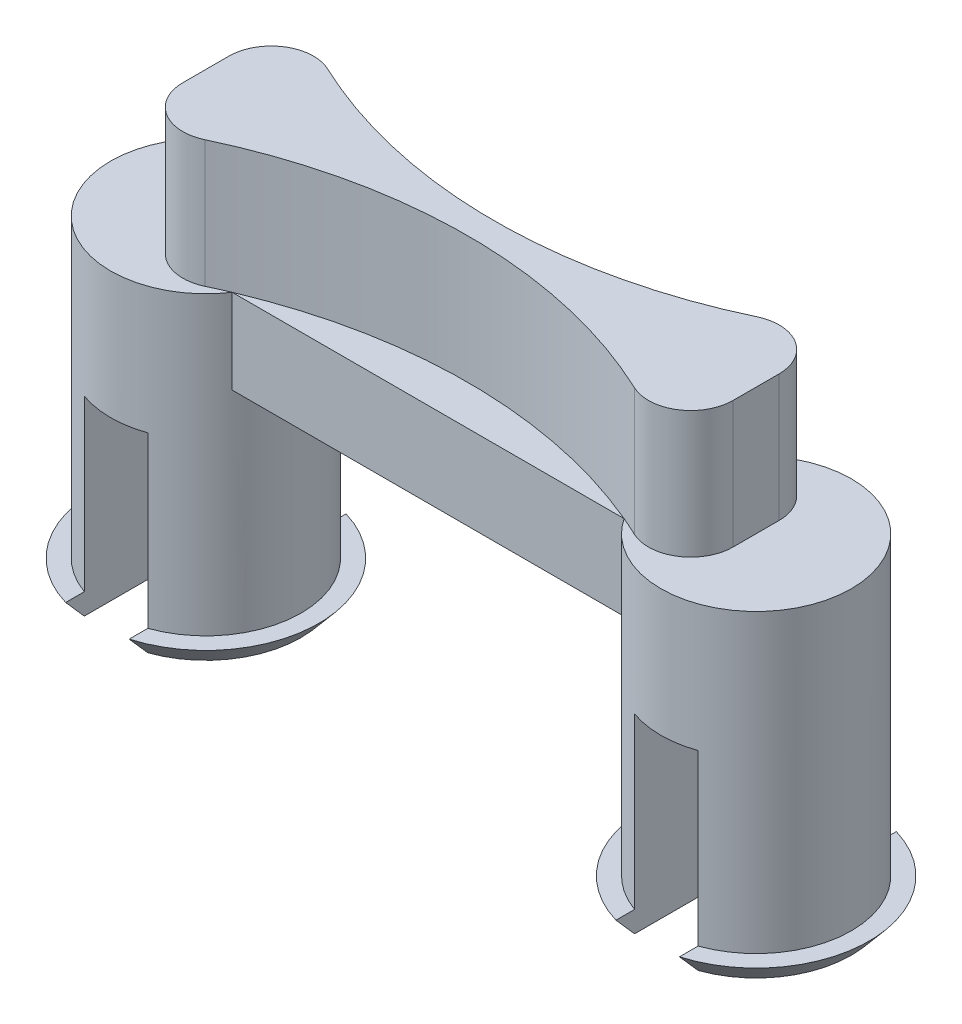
ISO-10303-21;
HEADER;
FILE_DESCRIPTION(('STEP AP214'),'2;1');
FILE_NAME('part.step','',(''),(''),'','','');
FILE_SCHEMA(('AUTOMOTIVE_DESIGN { 1 0 10303 214 1 1 1 1 }'));
ENDSEC;
DATA;
#1=APPLICATION_CONTEXT('core data for automotive mechanical design processes');
#2=APPLICATION_PROTOCOL_DEFINITION('international standard','automotive_design',2000,#1);
#3=PRODUCT_CONTEXT('',#1,'mechanical');
#4=PRODUCT('Part','Part','',(#3));
#5=PRODUCT_RELATED_PRODUCT_CATEGORY('part','',(#4));
#6=PRODUCT_DEFINITION_FORMATION('','',#4);
#7=PRODUCT_DEFINITION_CONTEXT('part definition',#1,'design');
#8=PRODUCT_DEFINITION('design','',#6,#7);
#9=PRODUCT_DEFINITION_SHAPE('','',#8);
#10=(LENGTH_UNIT() NAMED_UNIT(*) SI_UNIT(.MILLI.,.METRE.));
#11=(NAMED_UNIT(*) PLANE_ANGLE_UNIT() SI_UNIT($,.RADIAN.));
#12=(NAMED_UNIT(*) SI_UNIT($,.STERADIAN.) SOLID_ANGLE_UNIT());
#13=UNCERTAINTY_MEASURE_WITH_UNIT(LENGTH_MEASURE(1.E-05),#10,'distance_accuracy_value','');
#14=(GEOMETRIC_REPRESENTATION_CONTEXT(3) GLOBAL_UNCERTAINTY_ASSIGNED_CONTEXT((#13)) GLOBAL_UNIT_ASSIGNED_CONTEXT((#10,
#11,#12)) REPRESENTATION_CONTEXT('',''));
#15=CARTESIAN_POINT('',(0.,0.,0.));
#16=DIRECTION('',(0.,0.,1.));
#17=DIRECTION('',(1.,0.,0.));
#18=AXIS2_PLACEMENT_3D('',#15,#16,#17);
#19=CARTESIAN_POINT('',(0.,9.525,0.));
#20=DIRECTION('',(0.,1.,0.));
#21=DIRECTION('',(0.,0.,1.));
#22=AXIS2_PLACEMENT_3D('',#19,#20,#21);
#23=PLANE('',#22);
#24=CARTESIAN_POINT('',(8.255,9.525,-15.4436908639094));
#25=DIRECTION('',(0.,-1.,0.));
#26=DIRECTION('',(0.,0.,1.));
#27=AXIS2_PLACEMENT_3D('',#24,#25,#26);
#28=CIRCLE('',#27,15.0518180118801);
#29=CARTESIAN_POINT('',(14.1340475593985,9.525,-1.5875));
#30=VERTEX_POINT('',#29);
#31=CARTESIAN_POINT('',(2.37595244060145,9.525,-1.5875));
#32=VERTEX_POINT('',#31);
#33=EDGE_CURVE('E432',#30,#32,#28,.T.);
#34=ORIENTED_EDGE('',*,*,#33,.F.);
#35=DIRECTION('',(-1.,0.,0.));
#36=VECTOR('',#35,1.);
#37=CARTESIAN_POINT('',(2.37595244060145,9.525,-1.5875));
#38=LINE('',#37,#36);
#39=EDGE_CURVE('E263',#30,#32,#38,.T.);
#40=ORIENTED_EDGE('',*,*,#39,.T.);
#41=EDGE_LOOP('',(#34,#40));
#42=FACE_BOUND('',#41,.T.);
#43=ADVANCED_FACE('F39',(#42),#23,.T.);
#44=CARTESIAN_POINT('',(8.255,9.525,15.4436908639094));
#45=DIRECTION('',(0.,-1.,0.));
#46=DIRECTION('',(0.,0.,1.));
#47=AXIS2_PLACEMENT_3D('',#44,#45,#46);
#48=CIRCLE('',#47,15.0518180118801);
#49=CARTESIAN_POINT('',(1.81350256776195,9.525,1.83985551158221));
#50=VERTEX_POINT('',#49);
#51=CARTESIAN_POINT('',(2.37595244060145,9.525,1.5875));
#52=VERTEX_POINT('',#51);
#53=EDGE_CURVE('E425',#50,#52,#48,.T.);
#54=ORIENTED_EDGE('',*,*,#53,.F.);
#55=CARTESIAN_POINT('',(1.27,9.525,0.692029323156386));
#56=DIRECTION('',(0.,1.,0.));
#57=DIRECTION('',(0.,0.,1.));
#58=AXIS2_PLACEMENT_3D('',#55,#56,#57);
#59=CIRCLE('',#58,1.27);
#60=CARTESIAN_POINT('',(0.,9.525,0.692029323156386));
#61=VERTEX_POINT('',#60);
#62=EDGE_CURVE('E383',#50,#61,#59,.F.);
#63=ORIENTED_EDGE('',*,*,#62,.T.);
#64=DIRECTION('',(0.,0.,1.));
#65=VECTOR('',#64,1.);
#66=CARTESIAN_POINT('',(0.,9.525,2.8575));
#67=LINE('',#66,#65);
#68=CARTESIAN_POINT('',(0.,9.525,-0.692029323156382));
#69=VERTEX_POINT('',#68);
#70=EDGE_CURVE('E409',#69,#61,#67,.T.);
#71=ORIENTED_EDGE('',*,*,#70,.F.);
#72=CARTESIAN_POINT('',(1.27,9.525,-0.692029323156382));
#73=DIRECTION('',(0.,1.,0.));
#74=DIRECTION('',(0.,0.,1.));
#75=AXIS2_PLACEMENT_3D('',#72,#73,#74);
#76=CIRCLE('',#75,1.27);
#77=CARTESIAN_POINT('',(1.81350256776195,9.525,-1.83985551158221));
#78=VERTEX_POINT('',#77);
#79=EDGE_CURVE('E387',#69,#78,#76,.F.);
#80=ORIENTED_EDGE('',*,*,#79,.T.);
#81=EDGE_CURVE('E347',#32,#78,#28,.T.);
#82=ORIENTED_EDGE('',*,*,#81,.F.);
#83=CARTESIAN_POINT('',(0.,9.525,0.));
#84=DIRECTION('',(0.,1.,0.));
#85=DIRECTION('',(0.,0.,1.));
#86=AXIS2_PLACEMENT_3D('',#83,#84,#85);
#87=CIRCLE('',#86,2.8575);
#88=CARTESIAN_POINT('',(0.,9.525,-2.8575));
#89=VERTEX_POINT('',#88);
#90=EDGE_CURVE('E291',#32,#89,#87,.T.);
#91=ORIENTED_EDGE('',*,*,#90,.T.);
#92=CARTESIAN_POINT('',(0.,9.525,2.8575));
#93=VERTEX_POINT('',#92);
#94=EDGE_CURVE('E296',#89,#93,#87,.T.);
#95=ORIENTED_EDGE('',*,*,#94,.T.);
#96=EDGE_CURVE('E297',#93,#52,#87,.T.);
#97=ORIENTED_EDGE('',*,*,#96,.T.);
#98=EDGE_LOOP('',(#54,#63,#71,#80,#82,#91,#95,#97));
#99=FACE_BOUND('',#98,.T.);
#100=ADVANCED_FACE('F637',(#99),#23,.T.);
#101=CARTESIAN_POINT('',(14.1340475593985,9.525,1.5875));
#102=VERTEX_POINT('',#101);
#103=EDGE_CURVE('E428',#52,#102,#48,.T.);
#104=ORIENTED_EDGE('',*,*,#103,.F.);
#105=DIRECTION('',(1.,0.,0.));
#106=VECTOR('',#105,1.);
#107=CARTESIAN_POINT('',(14.1340475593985,9.525,1.5875));
#108=LINE('',#107,#106);
#109=EDGE_CURVE('E260',#52,#102,#108,.T.);
#110=ORIENTED_EDGE('',*,*,#109,.T.);
#111=EDGE_LOOP('',(#104,#110));
#112=FACE_BOUND('',#111,.T.);
#113=ADVANCED_FACE('F654',(#112),#23,.T.);
#114=CARTESIAN_POINT('',(14.6964974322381,9.525,-1.83985551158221));
#115=VERTEX_POINT('',#114);
#116=EDGE_CURVE('E415',#115,#30,#28,.T.);
#117=ORIENTED_EDGE('',*,*,#116,.F.);
#118=CARTESIAN_POINT('',(15.24,9.525,-0.692029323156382));
#119=DIRECTION('',(0.,1.,0.));
#120=DIRECTION('',(0.,0.,1.));
#121=AXIS2_PLACEMENT_3D('',#118,#119,#120);
#122=CIRCLE('',#121,1.27);
#123=CARTESIAN_POINT('',(16.51,9.525,-0.692029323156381));
#124=VERTEX_POINT('',#123);
#125=EDGE_CURVE('E11',#115,#124,#122,.F.);
#126=ORIENTED_EDGE('',*,*,#125,.T.);
#127=DIRECTION('',(0.,0.,-1.));
#128=VECTOR('',#127,1.);
#129=CARTESIAN_POINT('',(16.51,9.525,2.8575));
#130=LINE('',#129,#128);
#131=CARTESIAN_POINT('',(16.51,9.525,0.692029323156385));
#132=VERTEX_POINT('',#131);
#133=EDGE_CURVE('E55',#132,#124,#130,.T.);
#134=ORIENTED_EDGE('',*,*,#133,.F.);
#135=CARTESIAN_POINT('',(15.24,9.525,0.692029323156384));
#136=DIRECTION('',(0.,1.,0.));
#137=DIRECTION('',(0.,0.,1.));
#138=AXIS2_PLACEMENT_3D('',#135,#136,#137);
#139=CIRCLE('',#138,1.27);
#140=CARTESIAN_POINT('',(14.6964974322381,9.525,1.83985551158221));
#141=VERTEX_POINT('',#140);
#142=EDGE_CURVE('E48',#132,#141,#139,.F.);
#143=ORIENTED_EDGE('',*,*,#142,.T.);
#144=EDGE_CURVE('E62',#102,#141,#48,.T.);
#145=ORIENTED_EDGE('',*,*,#144,.F.);
#146=CARTESIAN_POINT('',(16.51,9.525,0.));
#147=DIRECTION('',(0.,1.,0.));
#148=DIRECTION('',(0.,0.,1.));
#149=AXIS2_PLACEMENT_3D('',#146,#147,#148);
#150=CIRCLE('',#149,2.8575);
#151=CARTESIAN_POINT('',(16.51,9.525,2.8575));
#152=VERTEX_POINT('',#151);
#153=EDGE_CURVE('E244',#102,#152,#150,.T.);
#154=ORIENTED_EDGE('',*,*,#153,.T.);
#155=CARTESIAN_POINT('',(16.51,9.525,-2.8575));
#156=VERTEX_POINT('',#155);
#157=EDGE_CURVE('E237',#152,#156,#150,.T.);
#158=ORIENTED_EDGE('',*,*,#157,.T.);
#159=EDGE_CURVE('E241',#156,#30,#150,.T.);
#160=ORIENTED_EDGE('',*,*,#159,.T.);
#161=EDGE_LOOP('',(#117,#126,#134,#143,#145,#154,#158,#160));
#162=FACE_BOUND('',#161,.T.);
#163=ADVANCED_FACE('F240',(#162),#23,.T.);
#164=CARTESIAN_POINT('',(0.,0.,0.));
#165=DIRECTION('',(0.,1.,0.));
#166=DIRECTION('',(0.,0.,-1.));
#167=AXIS2_PLACEMENT_3D('',#164,#165,#166);
#168=CONICAL_SURFACE('',#167,2.8575,0.698131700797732);
#169=CARTESIAN_POINT('',(-0.9525,4.72139506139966,6.75237119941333));
#170=CARTESIAN_POINT('',(-0.9525,4.48782195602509,6.55443143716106));
#171=CARTESIAN_POINT('',(-0.9525,4.25432468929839,6.35640203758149));
#172=CARTESIAN_POINT('',(-0.9525,3.78751881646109,5.96005235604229));
#173=CARTESIAN_POINT('',(-0.9525,3.55421024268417,5.76173203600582));
#174=CARTESIAN_POINT('',(-0.9525,3.08700174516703,5.36399304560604));
#175=CARTESIAN_POINT('',(-0.9525,2.85310293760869,5.16457306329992));
#176=CARTESIAN_POINT('',(-0.9525,2.38575763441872,4.76527079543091));
#177=CARTESIAN_POINT('',(-0.9525,2.15231107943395,4.56538857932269));
#178=CARTESIAN_POINT('',(-0.9525,1.62643505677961,4.11375752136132));
#179=CARTESIAN_POINT('',(-0.9525,1.3341778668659,3.86180758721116));
#180=CARTESIAN_POINT('',(-0.9525,0.896975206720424,3.48237787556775));
#181=CARTESIAN_POINT('',(-0.9525,0.751403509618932,3.35562001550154));
#182=CARTESIAN_POINT('',(-0.9525,0.460855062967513,3.10143572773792));
#183=CARTESIAN_POINT('',(-0.9525,0.315878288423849,2.97400932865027));
#184=CARTESIAN_POINT('',(-0.9525,0.0271882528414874,2.71856366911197));
#185=CARTESIAN_POINT('',(-0.9525,-0.116527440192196,2.59054715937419));
#186=CARTESIAN_POINT('',(-0.9525,-0.402712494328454,2.33307411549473));
#187=CARTESIAN_POINT('',(-0.9525,-0.545181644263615,2.20361734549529));
#188=CARTESIAN_POINT('',(-0.9525,-0.757248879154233,2.00777702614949));
#189=CARTESIAN_POINT('',(-0.9525,-0.827636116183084,1.94224880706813));
#190=CARTESIAN_POINT('',(-0.9525,-0.967705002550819,1.81044344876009));
#191=CARTESIAN_POINT('',(-0.9525,-1.03738666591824,1.74416632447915));
#192=CARTESIAN_POINT('',(-0.9525,-1.17577060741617,1.61063326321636));
#193=CARTESIAN_POINT('',(-0.9525,-1.24447314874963,1.54337759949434));
#194=CARTESIAN_POINT('',(-0.9525,-1.38051818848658,1.40750755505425));
#195=CARTESIAN_POINT('',(-0.9525,-1.44786081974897,1.33889330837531));
#196=CARTESIAN_POINT('',(-0.9525,-1.54447298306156,1.23753344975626));
#197=CARTESIAN_POINT('',(-0.9525,-1.57454787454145,1.20555570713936));
#198=CARTESIAN_POINT('',(-0.9525,-1.63417554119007,1.14111261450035));
#199=CARTESIAN_POINT('',(-0.9525,-1.66372828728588,1.10864723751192));
#200=CARTESIAN_POINT('',(-0.9525,-1.72223202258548,1.04308289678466));
#201=CARTESIAN_POINT('',(-0.9525,-1.75118196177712,1.00998299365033));
#202=CARTESIAN_POINT('',(-0.9525,-1.80825854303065,0.943080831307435));
#203=CARTESIAN_POINT('',(-0.9525,-1.83638522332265,0.909278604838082));
#204=CARTESIAN_POINT('',(-0.9525,-1.89119273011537,0.841301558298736));
#205=CARTESIAN_POINT('',(-0.9525,-1.91788835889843,0.807138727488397));
#206=CARTESIAN_POINT('',(-0.9525,-1.96993519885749,0.737805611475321));
#207=CARTESIAN_POINT('',(-0.9525,-1.99528663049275,0.70263549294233));
#208=CARTESIAN_POINT('',(-0.9525,-2.04414983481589,0.631146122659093));
#209=CARTESIAN_POINT('',(-0.9525,-2.06766561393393,0.594829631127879));
#210=CARTESIAN_POINT('',(-0.9525,-2.11227880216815,0.520749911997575));
#211=CARTESIAN_POINT('',(-0.9525,-2.13337786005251,0.48298769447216));
#212=CARTESIAN_POINT('',(-0.9525,-2.16734238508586,0.415575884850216));
#213=CARTESIAN_POINT('',(-0.9525,-2.18093899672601,0.386297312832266));
#214=CARTESIAN_POINT('',(-0.9525,-2.20581432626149,0.326755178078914));
#215=CARTESIAN_POINT('',(-0.9525,-2.21709287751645,0.2964915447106));
#216=CARTESIAN_POINT('',(-0.9525,-2.23669811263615,0.235269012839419));
#217=CARTESIAN_POINT('',(-0.9525,-2.24504746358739,0.204317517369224));
#218=CARTESIAN_POINT('',(-0.9525,-2.25838681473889,0.141701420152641));
#219=CARTESIAN_POINT('',(-0.9525,-2.26337769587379,0.110037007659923));
#220=CARTESIAN_POINT('',(-0.9525,-2.27122968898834,0.0292324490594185));
#221=CARTESIAN_POINT('',(-0.9525,-2.27152103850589,-0.0201900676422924));
#222=CARTESIAN_POINT('',(-0.9525,-2.2630654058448,-0.118339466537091));
#223=CARTESIAN_POINT('',(-0.9525,-2.25429047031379,-0.167063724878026));
#224=CARTESIAN_POINT('',(-0.9525,-2.22443980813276,-0.281004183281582));
#225=CARTESIAN_POINT('',(-0.9525,-2.19991374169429,-0.345289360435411));
#226=CARTESIAN_POINT('',(-0.9525,-2.15629463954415,-0.438398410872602));
#227=CARTESIAN_POINT('',(-0.9525,-2.14057088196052,-0.468950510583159));
#228=CARTESIAN_POINT('',(-0.9525,-2.10732395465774,-0.529060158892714));
#229=CARTESIAN_POINT('',(-0.9525,-2.08980131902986,-0.558617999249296));
#230=CARTESIAN_POINT('',(-0.9525,-2.03893654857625,-0.639909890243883));
#231=CARTESIAN_POINT('',(-0.9525,-2.00405450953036,-0.690671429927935));
#232=CARTESIAN_POINT('',(-0.9525,-1.93135469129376,-0.790063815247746));
#233=CARTESIAN_POINT('',(-0.9525,-1.89353462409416,-0.838692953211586));
#234=CARTESIAN_POINT('',(-0.9525,-1.81580153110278,-0.934430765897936));
#235=CARTESIAN_POINT('',(-0.9525,-1.77588370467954,-0.981535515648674));
#236=CARTESIAN_POINT('',(-0.9525,-1.6946135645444,-1.0744953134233));
#237=CARTESIAN_POINT('',(-0.9525,-1.65326101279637,-1.12035015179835));
#238=CARTESIAN_POINT('',(-0.9525,-1.52717871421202,-1.25699315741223));
#239=CARTESIAN_POINT('',(-0.9525,-1.44087413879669,-1.34632523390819));
#240=CARTESIAN_POINT('',(-0.9525,-1.30969233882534,-1.47843447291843));
#241=CARTESIAN_POINT('',(-0.9525,-1.26571386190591,-1.52212148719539));
#242=CARTESIAN_POINT('',(-0.9525,-1.17726739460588,-1.60899632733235));
#243=CARTESIAN_POINT('',(-0.9525,-1.13279941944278,-1.65218416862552));
#244=CARTESIAN_POINT('',(-0.9525,-1.00019856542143,-1.77981378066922));
#245=CARTESIAN_POINT('',(-0.9525,-0.911509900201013,-1.86367710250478));
#246=CARTESIAN_POINT('',(-0.9525,-0.733113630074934,-2.0303149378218));
#247=CARTESIAN_POINT('',(-0.9525,-0.643405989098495,-2.11308941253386));
#248=CARTESIAN_POINT('',(-0.9525,-0.373195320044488,-2.36026062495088));
#249=CARTESIAN_POINT('',(-0.9525,-0.19162341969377,-2.52348727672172));
#250=CARTESIAN_POINT('',(-0.9525,0.173252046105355,-2.84831310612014));
#251=CARTESIAN_POINT('',(-0.9525,0.356557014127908,-3.00991069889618));
#252=CARTESIAN_POINT('',(-0.9525,0.724143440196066,-3.33196706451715));
#253=CARTESIAN_POINT('',(-0.9525,0.908424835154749,-3.49242590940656));
#254=CARTESIAN_POINT('',(-0.9525,1.27676115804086,-3.81183089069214));
#255=CARTESIAN_POINT('',(-0.9525,1.46081299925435,-3.97078059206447));
#256=CARTESIAN_POINT('',(-0.9525,1.82937225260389,-4.28815674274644));
#257=CARTESIAN_POINT('',(-0.9525,2.01387967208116,-4.44658318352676));
#258=CARTESIAN_POINT('',(-0.9525,2.56777490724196,-4.92120268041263));
#259=CARTESIAN_POINT('',(-0.9525,2.93764618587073,-5.23683136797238));
#260=CARTESIAN_POINT('',(-0.9525,3.42543629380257,-5.65210954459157));
#261=CARTESIAN_POINT('',(-0.9525,3.54302697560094,-5.75214528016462));
#262=CARTESIAN_POINT('',(-0.9525,3.77828079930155,-5.952145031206));
#263=CARTESIAN_POINT('',(-0.9525,3.89594394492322,-6.05210904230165));
#264=CARTESIAN_POINT('',(-0.9525,4.13154698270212,-6.2521587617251));
#265=CARTESIAN_POINT('',(-0.9525,4.24948697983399,-6.35224434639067));
#266=CARTESIAN_POINT('',(-0.9525,4.48540933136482,-6.5523519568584));
#267=CARTESIAN_POINT('',(-0.9525,4.60339168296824,-6.65237398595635));
#268=CARTESIAN_POINT('',(-0.9525,4.72139506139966,-6.75237119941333));
#269=B_SPLINE_CURVE_WITH_KNOTS('',3,(#169,#170,#171,#172,#173,#174,#175,#176,#177,#178,#179,
#180,#181,#182,#183,#184,#185,#186,#187,#188,#189,#190,#191,#192,#193,#194,#195,#196,#197,#198,
#199,#200,#201,#202,#203,#204,#205,#206,#207,#208,#209,#210,#211,#212,#213,#214,#215,#216,#217,
#218,#219,#220,#221,#222,#223,#224,#225,#226,#227,#228,#229,#230,#231,#232,#233,#234,#235,#236,
#237,#238,#239,#240,#241,#242,#243,#244,#245,#246,#247,#248,#249,#250,#251,#252,#253,#254,#255,
#256,#257,#258,#259,#260,#261,#262,#263,#264,#265,#266,#267,#268),.UNSPECIFIED.,.F.,.F.,(4,2,2,
2,2,2,2,2,2,2,2,2,2,2,2,2,2,2,2,2,2,2,2,2,2,2,2,2,2,2,2,2,2,2,2,2,2,2,2,2,2,2,2,2,2,2,2,2,2,4),
(0.,0.91849284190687,1.83711911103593,2.75923175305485,3.68121383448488,4.83880761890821,
5.41788148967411,5.99693077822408,6.57431836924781,7.15180194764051,7.44030254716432,
7.72879739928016,8.01721317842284,8.30560064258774,8.43729157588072,8.56898981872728,
8.70090096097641,8.83280596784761,8.96284957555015,9.09287178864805,9.22260178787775,
9.35224274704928,9.44900932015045,9.54578284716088,9.64179007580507,9.73777211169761,
9.88512793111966,10.0329394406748,10.2380654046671,10.3411211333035,10.4441463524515,
10.6287487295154,10.8134963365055,10.9986868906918,11.1839083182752,11.5564447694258,
11.742412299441,11.9283740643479,12.2945407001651,12.6607203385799,13.3931575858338,
14.1262494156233,14.8592944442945,15.5888553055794,16.3184280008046,17.7771353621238,
18.2402902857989,18.703471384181,19.167521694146,19.6315455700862),.UNSPECIFIED.);
#270=CARTESIAN_POINT('',(-0.9525,0.635,3.25377772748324));
#271=VERTEX_POINT('',#270);
#272=CARTESIAN_POINT('',(-0.9525,0.,2.69407683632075));
#273=VERTEX_POINT('',#272);
#274=EDGE_CURVE('E545',#271,#273,#269,.T.);
#275=ORIENTED_EDGE('',*,*,#274,.F.);
#276=CARTESIAN_POINT('',(0.,0.635,0.));
#277=DIRECTION('',(0.,-1.,0.));
#278=DIRECTION('',(0.,0.,-1.));
#279=AXIS2_PLACEMENT_3D('',#276,#277,#278);
#280=CIRCLE('',#279,3.39032826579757);
#281=CARTESIAN_POINT('',(-0.9525,0.635,-3.25377772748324));
#282=VERTEX_POINT('',#281);
#283=EDGE_CURVE('E558',#271,#282,#280,.T.);
#284=ORIENTED_EDGE('',*,*,#283,.T.);
#285=CARTESIAN_POINT('',(-0.9525,0.,-2.69407683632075));
#286=VERTEX_POINT('',#285);
#287=EDGE_CURVE('E535',#286,#282,#269,.T.);
#288=ORIENTED_EDGE('',*,*,#287,.F.);
#289=CARTESIAN_POINT('',(0.,0.,0.));
#290=DIRECTION('',(0.,1.,0.));
#291=DIRECTION('',(0.,0.,1.));
#292=AXIS2_PLACEMENT_3D('',#289,#290,#291);
#293=CIRCLE('',#292,2.8575);
#294=EDGE_CURVE('E280',#286,#273,#293,.T.);
#295=ORIENTED_EDGE('',*,*,#294,.T.);
#296=EDGE_LOOP('',(#275,#284,#288,#295));
#297=FACE_BOUND('',#296,.T.);
#298=ADVANCED_FACE('F574',(#297),#168,.T.);
#299=CARTESIAN_POINT('',(0.,0.635,0.));
#300=DIRECTION('',(0.,-1.,0.));
#301=DIRECTION('',(0.,0.,-1.));
#302=AXIS2_PLACEMENT_3D('',#299,#300,#301);
#303=PLANE('',#302);
#304=ORIENTED_EDGE('',*,*,#283,.F.);
#305=DIRECTION('',(0.,0.,-1.));
#306=VECTOR('',#305,1.);
#307=CARTESIAN_POINT('',(-0.9525,0.635,0.));
#308=LINE('',#307,#306);
#309=CARTESIAN_POINT('',(-0.9525,0.635,2.69407683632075));
#310=VERTEX_POINT('',#309);
#311=EDGE_CURVE('E549',#271,#310,#308,.T.);
#312=ORIENTED_EDGE('',*,*,#311,.T.);
#313=CARTESIAN_POINT('',(0.,0.635,0.));
#314=DIRECTION('',(0.,-1.,0.));
#315=DIRECTION('',(0.,0.,-1.));
#316=AXIS2_PLACEMENT_3D('',#313,#314,#315);
#317=CIRCLE('',#316,2.8575);
#318=CARTESIAN_POINT('',(-0.9525,0.635,-2.69407683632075));
#319=VERTEX_POINT('',#318);
#320=EDGE_CURVE('E309',#310,#319,#317,.T.);
#321=ORIENTED_EDGE('',*,*,#320,.T.);
#322=EDGE_CURVE('E544',#319,#282,#308,.T.);
#323=ORIENTED_EDGE('',*,*,#322,.T.);
#324=EDGE_LOOP('',(#304,#312,#321,#323));
#325=FACE_BOUND('',#324,.T.);
#326=ADVANCED_FACE('F580',(#325),#303,.F.);
#327=CARTESIAN_POINT('',(0.,0.,0.));
#328=DIRECTION('',(0.,1.,0.));
#329=DIRECTION('',(0.,0.,1.));
#330=AXIS2_PLACEMENT_3D('',#327,#328,#329);
#331=PLANE('',#330);
#332=ORIENTED_EDGE('',*,*,#294,.F.);
#333=DIRECTION('',(0.,0.,1.));
#334=VECTOR('',#333,1.);
#335=CARTESIAN_POINT('',(-0.9525,0.,0.));
#336=LINE('',#335,#334);
#337=EDGE_CURVE('E331',#286,#273,#336,.T.);
#338=ORIENTED_EDGE('',*,*,#337,.T.);
#339=EDGE_LOOP('',(#332,#338));
#340=FACE_BOUND('',#339,.T.);
#341=ADVANCED_FACE('F590',(#340),#331,.F.);
#342=CARTESIAN_POINT('',(16.51,0.,0.));
#343=DIRECTION('',(0.,1.,0.));
#344=DIRECTION('',(0.,0.,-1.));
#345=AXIS2_PLACEMENT_3D('',#342,#343,#344);
#346=CONICAL_SURFACE('',#345,2.8575,0.698131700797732);
#347=CARTESIAN_POINT('',(15.5575,4.72139506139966,6.75237119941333));
#348=CARTESIAN_POINT('',(15.5575,4.48782195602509,6.55443143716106));
#349=CARTESIAN_POINT('',(15.5575,4.25432468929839,6.35640203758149));
#350=CARTESIAN_POINT('',(15.5575,3.78751881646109,5.96005235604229));
#351=CARTESIAN_POINT('',(15.5575,3.55421024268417,5.76173203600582));
#352=CARTESIAN_POINT('',(15.5575,3.08700174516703,5.36399304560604));
#353=CARTESIAN_POINT('',(15.5575,2.85310293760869,5.16457306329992));
#354=CARTESIAN_POINT('',(15.5575,2.38575763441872,4.76527079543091));
#355=CARTESIAN_POINT('',(15.5575,2.15231107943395,4.56538857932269));
#356=CARTESIAN_POINT('',(15.5575,1.62643505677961,4.11375752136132));
#357=CARTESIAN_POINT('',(15.5575,1.3341778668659,3.86180758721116));
#358=CARTESIAN_POINT('',(15.5575,0.896975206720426,3.48237787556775));
#359=CARTESIAN_POINT('',(15.5575,0.751403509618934,3.35562001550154));
#360=CARTESIAN_POINT('',(15.5575,0.460855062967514,3.10143572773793));
#361=CARTESIAN_POINT('',(15.5575,0.31587828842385,2.97400932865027));
#362=CARTESIAN_POINT('',(15.5575,0.0271882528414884,2.71856366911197));
#363=CARTESIAN_POINT('',(15.5575,-0.116527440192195,2.59054715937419));
#364=CARTESIAN_POINT('',(15.5575,-0.402712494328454,2.33307411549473));
#365=CARTESIAN_POINT('',(15.5575,-0.545181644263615,2.20361734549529));
#366=CARTESIAN_POINT('',(15.5575,-0.757248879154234,2.00777702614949));
#367=CARTESIAN_POINT('',(15.5575,-0.827636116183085,1.94224880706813));
#368=CARTESIAN_POINT('',(15.5575,-0.967705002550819,1.81044344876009));
#369=CARTESIAN_POINT('',(15.5575,-1.03738666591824,1.74416632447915));
#370=CARTESIAN_POINT('',(15.5575,-1.17577060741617,1.61063326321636));
#371=CARTESIAN_POINT('',(15.5575,-1.24447314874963,1.54337759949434));
#372=CARTESIAN_POINT('',(15.5575,-1.38051818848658,1.40750755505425));
#373=CARTESIAN_POINT('',(15.5575,-1.44786081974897,1.33889330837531));
#374=CARTESIAN_POINT('',(15.5575,-1.54447298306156,1.23753344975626));
#375=CARTESIAN_POINT('',(15.5575,-1.57454787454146,1.20555570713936));
#376=CARTESIAN_POINT('',(15.5575,-1.63417554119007,1.14111261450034));
#377=CARTESIAN_POINT('',(15.5575,-1.66372828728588,1.10864723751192));
#378=CARTESIAN_POINT('',(15.5575,-1.72223202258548,1.04308289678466));
#379=CARTESIAN_POINT('',(15.5575,-1.75118196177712,1.00998299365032));
#380=CARTESIAN_POINT('',(15.5575,-1.80825854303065,0.943080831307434));
#381=CARTESIAN_POINT('',(15.5575,-1.83638522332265,0.90927860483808));
#382=CARTESIAN_POINT('',(15.5575,-1.89119273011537,0.841301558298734));
#383=CARTESIAN_POINT('',(15.5575,-1.91788835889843,0.807138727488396));
#384=CARTESIAN_POINT('',(15.5575,-1.96993519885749,0.73780561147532));
#385=CARTESIAN_POINT('',(15.5575,-1.99528663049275,0.702635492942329));
#386=CARTESIAN_POINT('',(15.5575,-2.04414983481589,0.63114612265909));
#387=CARTESIAN_POINT('',(15.5575,-2.06766561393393,0.594829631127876));
#388=CARTESIAN_POINT('',(15.5575,-2.11227880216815,0.520749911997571));
#389=CARTESIAN_POINT('',(15.5575,-2.13337786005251,0.482987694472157));
#390=CARTESIAN_POINT('',(15.5575,-2.16734238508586,0.415575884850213));
#391=CARTESIAN_POINT('',(15.5575,-2.18093899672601,0.386297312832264));
#392=CARTESIAN_POINT('',(15.5575,-2.20581432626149,0.326755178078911));
#393=CARTESIAN_POINT('',(15.5575,-2.21709287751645,0.296491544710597));
#394=CARTESIAN_POINT('',(15.5575,-2.23669811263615,0.235269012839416));
#395=CARTESIAN_POINT('',(15.5575,-2.24504746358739,0.204317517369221));
#396=CARTESIAN_POINT('',(15.5575,-2.25838681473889,0.141701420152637));
#397=CARTESIAN_POINT('',(15.5575,-2.26337769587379,0.110037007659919));
#398=CARTESIAN_POINT('',(15.5575,-2.27122968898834,0.0292324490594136));
#399=CARTESIAN_POINT('',(15.5575,-2.27152103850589,-0.0201900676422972));
#400=CARTESIAN_POINT('',(15.5575,-2.26306540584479,-0.118339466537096));
#401=CARTESIAN_POINT('',(15.5575,-2.25429047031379,-0.167063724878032));
#402=CARTESIAN_POINT('',(15.5575,-2.22443980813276,-0.281004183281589));
#403=CARTESIAN_POINT('',(15.5575,-2.19991374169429,-0.345289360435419));
#404=CARTESIAN_POINT('',(15.5575,-2.15629463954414,-0.438398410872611));
#405=CARTESIAN_POINT('',(15.5575,-2.14057088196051,-0.468950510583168));
#406=CARTESIAN_POINT('',(15.5575,-2.10732395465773,-0.529060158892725));
#407=CARTESIAN_POINT('',(15.5575,-2.08980131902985,-0.558617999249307));
#408=CARTESIAN_POINT('',(15.5575,-2.03893654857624,-0.639909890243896));
#409=CARTESIAN_POINT('',(15.5575,-2.00405450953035,-0.69067142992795));
#410=CARTESIAN_POINT('',(15.5575,-1.93135469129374,-0.790063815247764));
#411=CARTESIAN_POINT('',(15.5575,-1.89353462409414,-0.838692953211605));
#412=CARTESIAN_POINT('',(15.5575,-1.81580153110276,-0.934430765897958));
#413=CARTESIAN_POINT('',(15.5575,-1.77588370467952,-0.981535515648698));
#414=CARTESIAN_POINT('',(15.5575,-1.69461356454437,-1.07449531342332));
#415=CARTESIAN_POINT('',(15.5575,-1.65326101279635,-1.12035015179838));
#416=CARTESIAN_POINT('',(15.5575,-1.52717871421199,-1.25699315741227));
#417=CARTESIAN_POINT('',(15.5575,-1.44087413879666,-1.34632523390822));
#418=CARTESIAN_POINT('',(15.5575,-1.3096923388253,-1.47843447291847));
#419=CARTESIAN_POINT('',(15.5575,-1.26571386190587,-1.52212148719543));
#420=CARTESIAN_POINT('',(15.5575,-1.17726739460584,-1.60899632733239));
#421=CARTESIAN_POINT('',(15.5575,-1.13279941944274,-1.65218416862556));
#422=CARTESIAN_POINT('',(15.5575,-1.00019856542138,-1.77981378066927));
#423=CARTESIAN_POINT('',(15.5575,-0.911509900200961,-1.86367710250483));
#424=CARTESIAN_POINT('',(15.5575,-0.733113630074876,-2.03031493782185));
#425=CARTESIAN_POINT('',(15.5575,-0.643405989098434,-2.11308941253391));
#426=CARTESIAN_POINT('',(15.5575,-0.373195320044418,-2.36026062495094));
#427=CARTESIAN_POINT('',(15.5575,-0.191623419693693,-2.52348727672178));
#428=CARTESIAN_POINT('',(15.5575,0.173252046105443,-2.84831310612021));
#429=CARTESIAN_POINT('',(15.5575,0.356557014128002,-3.00991069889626));
#430=CARTESIAN_POINT('',(15.5575,0.724143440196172,-3.33196706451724));
#431=CARTESIAN_POINT('',(15.5575,0.908424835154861,-3.49242590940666));
#432=CARTESIAN_POINT('',(15.5575,1.27676115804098,-3.81183089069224));
#433=CARTESIAN_POINT('',(15.5575,1.46081299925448,-3.97078059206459));
#434=CARTESIAN_POINT('',(15.5575,1.82937225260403,-4.28815674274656));
#435=CARTESIAN_POINT('',(15.5575,2.01387967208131,-4.44658318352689));
#436=CARTESIAN_POINT('',(15.5575,2.56777490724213,-4.92120268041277));
#437=CARTESIAN_POINT('',(15.5575,2.93764618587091,-5.23683136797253));
#438=CARTESIAN_POINT('',(15.5575,3.42543629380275,-5.65210954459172));
#439=CARTESIAN_POINT('',(15.5575,3.5430269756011,-5.75214528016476));
#440=CARTESIAN_POINT('',(15.5575,3.77828079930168,-5.95214503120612));
#441=CARTESIAN_POINT('',(15.5575,3.89594394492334,-6.05210904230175));
#442=CARTESIAN_POINT('',(15.5575,4.1315469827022,-6.25215876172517));
#443=CARTESIAN_POINT('',(15.5575,4.24948697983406,-6.35224434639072));
#444=CARTESIAN_POINT('',(15.5575,4.48540933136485,-6.55235195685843));
#445=CARTESIAN_POINT('',(15.5575,4.60339168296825,-6.65237398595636));
#446=CARTESIAN_POINT('',(15.5575,4.72139506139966,-6.75237119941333));
#447=B_SPLINE_CURVE_WITH_KNOTS('',3,(#347,#348,#349,#350,#351,#352,#353,#354,#355,#356,#357,
#358,#359,#360,#361,#362,#363,#364,#365,#366,#367,#368,#369,#370,#371,#372,#373,#374,#375,#376,
#377,#378,#379,#380,#381,#382,#383,#384,#385,#386,#387,#388,#389,#390,#391,#392,#393,#394,#395,
#396,#397,#398,#399,#400,#401,#402,#403,#404,#405,#406,#407,#408,#409,#410,#411,#412,#413,#414,
#415,#416,#417,#418,#419,#420,#421,#422,#423,#424,#425,#426,#427,#428,#429,#430,#431,#432,#433,
#434,#435,#436,#437,#438,#439,#440,#441,#442,#443,#444,#445,#446),.UNSPECIFIED.,.F.,.F.,(4,2,2,
2,2,2,2,2,2,2,2,2,2,2,2,2,2,2,2,2,2,2,2,2,2,2,2,2,2,2,2,2,2,2,2,2,2,2,2,2,2,2,2,2,2,2,2,2,2,4),
(0.,0.918492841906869,1.83711911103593,2.75923175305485,3.68121383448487,4.8388076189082,
5.41788148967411,5.99693077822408,6.57431836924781,7.15180194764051,7.44030254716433,
7.72879739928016,8.01721317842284,8.30560064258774,8.43729157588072,8.56898981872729,
8.70090096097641,8.83280596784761,8.96284957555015,9.09287178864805,9.22260178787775,
9.35224274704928,9.44900932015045,9.54578284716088,9.64179007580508,9.73777211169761,
9.88512793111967,10.0329394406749,10.2380654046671,10.3411211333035,10.4441463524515,
10.6287487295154,10.8134963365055,10.9986868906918,11.1839083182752,11.5564447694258,
11.7424122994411,11.928374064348,12.2945407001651,12.66072033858,13.3931575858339,
14.1262494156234,14.8592944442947,15.5888553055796,16.3184280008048,17.777135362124,
18.2402902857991,18.7034713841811,19.167521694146,19.6315455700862),.UNSPECIFIED.);
#448=CARTESIAN_POINT('',(15.5575,0.635,3.25377772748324));
#449=VERTEX_POINT('',#448);
#450=CARTESIAN_POINT('',(15.5575,0.,2.69407683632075));
#451=VERTEX_POINT('',#450);
#452=EDGE_CURVE('E495',#449,#451,#447,.T.);
#453=ORIENTED_EDGE('',*,*,#452,.F.);
#454=CARTESIAN_POINT('',(16.51,0.635,0.));
#455=DIRECTION('',(0.,-1.,0.));
#456=DIRECTION('',(0.,0.,-1.));
#457=AXIS2_PLACEMENT_3D('',#454,#455,#456);
#458=CIRCLE('',#457,3.39032826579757);
#459=CARTESIAN_POINT('',(15.5575,0.635,-3.25377772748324));
#460=VERTEX_POINT('',#459);
#461=EDGE_CURVE('E554',#449,#460,#458,.T.);
#462=ORIENTED_EDGE('',*,*,#461,.T.);
#463=CARTESIAN_POINT('',(15.5575,0.,-2.69407683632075));
#464=VERTEX_POINT('',#463);
#465=EDGE_CURVE('E485',#464,#460,#447,.T.);
#466=ORIENTED_EDGE('',*,*,#465,.F.);
#467=CARTESIAN_POINT('',(16.51,0.,0.));
#468=DIRECTION('',(0.,1.,0.));
#469=DIRECTION('',(0.,0.,1.));
#470=AXIS2_PLACEMENT_3D('',#467,#468,#469);
#471=CIRCLE('',#470,2.8575);
#472=EDGE_CURVE('E256',#464,#451,#471,.T.);
#473=ORIENTED_EDGE('',*,*,#472,.T.);
#474=EDGE_LOOP('',(#453,#462,#466,#473));
#475=FACE_BOUND('',#474,.T.);
#476=ADVANCED_FACE('F775',(#475),#346,.T.);
#477=CARTESIAN_POINT('',(16.51,0.635,0.));
#478=DIRECTION('',(0.,-1.,0.));
#479=DIRECTION('',(0.,0.,-1.));
#480=AXIS2_PLACEMENT_3D('',#477,#478,#479);
#481=PLANE('',#480);
#482=ORIENTED_EDGE('',*,*,#461,.F.);
#483=DIRECTION('',(0.,0.,-1.));
#484=VECTOR('',#483,1.);
#485=CARTESIAN_POINT('',(15.5575,0.635,0.));
#486=LINE('',#485,#484);
#487=CARTESIAN_POINT('',(15.5575,0.635,2.69407683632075));
#488=VERTEX_POINT('',#487);
#489=EDGE_CURVE('E499',#449,#488,#486,.T.);
#490=ORIENTED_EDGE('',*,*,#489,.T.);
#491=CARTESIAN_POINT('',(16.51,0.635,0.));
#492=DIRECTION('',(0.,-1.,0.));
#493=DIRECTION('',(0.,0.,-1.));
#494=AXIS2_PLACEMENT_3D('',#491,#492,#493);
#495=CIRCLE('',#494,2.8575);
#496=CARTESIAN_POINT('',(15.5575,0.635,-2.69407683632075));
#497=VERTEX_POINT('',#496);
#498=EDGE_CURVE('E314',#488,#497,#495,.T.);
#499=ORIENTED_EDGE('',*,*,#498,.T.);
#500=EDGE_CURVE('E494',#497,#460,#486,.T.);
#501=ORIENTED_EDGE('',*,*,#500,.T.);
#502=EDGE_LOOP('',(#482,#490,#499,#501));
#503=FACE_BOUND('',#502,.T.);
#504=ADVANCED_FACE('F783',(#503),#481,.F.);
#505=CARTESIAN_POINT('',(16.51,0.,0.));
#506=DIRECTION('',(0.,1.,0.));
#507=DIRECTION('',(0.,0.,1.));
#508=AXIS2_PLACEMENT_3D('',#505,#506,#507);
#509=PLANE('',#508);
#510=ORIENTED_EDGE('',*,*,#472,.F.);
#511=DIRECTION('',(0.,0.,1.));
#512=VECTOR('',#511,1.);
#513=CARTESIAN_POINT('',(15.5575,0.,0.));
#514=LINE('',#513,#512);
#515=EDGE_CURVE('E323',#464,#451,#514,.T.);
#516=ORIENTED_EDGE('',*,*,#515,.T.);
#517=EDGE_LOOP('',(#510,#516));
#518=FACE_BOUND('',#517,.T.);
#519=ADVANCED_FACE('F821',(#518),#509,.F.);
#520=CARTESIAN_POINT('',(16.51,9.525,0.));
#521=DIRECTION('',(0.,-1.,0.));
#522=DIRECTION('',(0.,0.,-1.));
#523=AXIS2_PLACEMENT_3D('',#520,#521,#522);
#524=CYLINDRICAL_SURFACE('',#523,2.8575);
#525=ORIENTED_EDGE('',*,*,#498,.F.);
#526=DIRECTION('',(0.,-1.,0.));
#527=VECTOR('',#526,1.);
#528=CARTESIAN_POINT('',(15.5575,9.525,2.69407683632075));
#529=LINE('',#528,#527);
#530=CARTESIAN_POINT('',(15.5575,5.715,2.69407683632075));
#531=VERTEX_POINT('',#530);
#532=EDGE_CURVE('E500',#488,#531,#529,.F.);
#533=ORIENTED_EDGE('',*,*,#532,.T.);
#534=CARTESIAN_POINT('',(16.51,5.715,0.));
#535=DIRECTION('',(0.,-1.,0.));
#536=DIRECTION('',(0.,0.,-1.));
#537=AXIS2_PLACEMENT_3D('',#534,#535,#536);
#538=CIRCLE('',#537,2.8575);
#539=CARTESIAN_POINT('',(17.4625,5.715,2.69407683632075));
#540=VERTEX_POINT('',#539);
#541=EDGE_CURVE('E342',#540,#531,#538,.T.);
#542=ORIENTED_EDGE('',*,*,#541,.F.);
#543=DIRECTION('',(0.,-1.,0.));
#544=VECTOR('',#543,1.);
#545=CARTESIAN_POINT('',(17.4625,9.525,2.69407683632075));
#546=LINE('',#545,#544);
#547=CARTESIAN_POINT('',(17.4625,0.635,2.69407683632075));
#548=VERTEX_POINT('',#547);
#549=EDGE_CURVE('E463',#540,#548,#546,.T.);
#550=ORIENTED_EDGE('',*,*,#549,.T.);
#551=CARTESIAN_POINT('',(17.4625,0.635,-2.69407683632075));
#552=VERTEX_POINT('',#551);
#553=EDGE_CURVE('E315',#552,#548,#495,.T.);
#554=ORIENTED_EDGE('',*,*,#553,.F.);
#555=DIRECTION('',(0.,-1.,0.));
#556=VECTOR('',#555,1.);
#557=CARTESIAN_POINT('',(17.4625,9.525,-2.69407683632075));
#558=LINE('',#557,#556);
#559=CARTESIAN_POINT('',(17.4625,5.715,-2.69407683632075));
#560=VERTEX_POINT('',#559);
#561=EDGE_CURVE('E806',#552,#560,#558,.F.);
#562=ORIENTED_EDGE('',*,*,#561,.T.);
#563=CARTESIAN_POINT('',(15.5575,5.715,-2.69407683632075));
#564=VERTEX_POINT('',#563);
#565=EDGE_CURVE('E339',#564,#560,#538,.T.);
#566=ORIENTED_EDGE('',*,*,#565,.F.);
#567=DIRECTION('',(0.,-1.,0.));
#568=VECTOR('',#567,1.);
#569=CARTESIAN_POINT('',(15.5575,9.525,-2.69407683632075));
#570=LINE('',#569,#568);
#571=EDGE_CURVE('E493',#564,#497,#570,.T.);
#572=ORIENTED_EDGE('',*,*,#571,.T.);
#573=EDGE_LOOP('',(#525,#533,#542,#550,#554,#562,#566,#572));
#574=FACE_BOUND('',#573,.T.);
#575=DIRECTION('',(0.,1.,0.));
#576=VECTOR('',#575,1.);
#577=CARTESIAN_POINT('',(14.1340475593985,6.985,-1.5875));
#578=LINE('',#577,#576);
#579=CARTESIAN_POINT('',(14.1340475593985,6.985,-1.5875));
#580=VERTEX_POINT('',#579);
#581=EDGE_CURVE('E250',#580,#30,#578,.T.);
#582=ORIENTED_EDGE('',*,*,#581,.T.);
#583=ORIENTED_EDGE('',*,*,#159,.F.);
#584=ORIENTED_EDGE('',*,*,#157,.F.);
#585=ORIENTED_EDGE('',*,*,#153,.F.);
#586=DIRECTION('',(0.,1.,0.));
#587=VECTOR('',#586,1.);
#588=CARTESIAN_POINT('',(14.1340475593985,6.985,1.5875));
#589=LINE('',#588,#587);
#590=CARTESIAN_POINT('',(14.1340475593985,6.985,1.5875));
#591=VERTEX_POINT('',#590);
#592=EDGE_CURVE('E283',#591,#102,#589,.T.);
#593=ORIENTED_EDGE('',*,*,#592,.F.);
#594=CARTESIAN_POINT('',(16.51,6.985,0.));
#595=DIRECTION('',(0.,-1.,0.));
#596=DIRECTION('',(0.,0.,-1.));
#597=AXIS2_PLACEMENT_3D('',#594,#595,#596);
#598=CIRCLE('',#597,2.8575);
#599=EDGE_CURVE('E305',#580,#591,#598,.F.);
#600=ORIENTED_EDGE('',*,*,#599,.F.);
#601=EDGE_LOOP('',(#582,#583,#584,#585,#593,#600));
#602=FACE_BOUND('',#601,.T.);
#603=ADVANCED_FACE('F248',(#574,#602),#524,.T.);
#604=CARTESIAN_POINT('',(0.,9.525,0.));
#605=DIRECTION('',(0.,-1.,0.));
#606=DIRECTION('',(0.,0.,-1.));
#607=AXIS2_PLACEMENT_3D('',#604,#605,#606);
#608=CYLINDRICAL_SURFACE('',#607,2.8575);
#609=ORIENTED_EDGE('',*,*,#320,.F.);
#610=DIRECTION('',(0.,-1.,0.));
#611=VECTOR('',#610,1.);
#612=CARTESIAN_POINT('',(-0.9525,9.525,2.69407683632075));
#613=LINE('',#612,#611);
#614=CARTESIAN_POINT('',(-0.9525,5.715,2.69407683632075));
#615=VERTEX_POINT('',#614);
#616=EDGE_CURVE('E550',#310,#615,#613,.F.);
#617=ORIENTED_EDGE('',*,*,#616,.T.);
#618=CARTESIAN_POINT('',(0.,5.715,0.));
#619=DIRECTION('',(0.,-1.,0.));
#620=DIRECTION('',(0.,0.,-1.));
#621=AXIS2_PLACEMENT_3D('',#618,#619,#620);
#622=CIRCLE('',#621,2.8575);
#623=CARTESIAN_POINT('',(0.9525,5.715,2.69407683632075));
#624=VERTEX_POINT('',#623);
#625=EDGE_CURVE('E338',#624,#615,#622,.T.);
#626=ORIENTED_EDGE('',*,*,#625,.F.);
#627=DIRECTION('',(0.,-1.,0.));
#628=VECTOR('',#627,1.);
#629=CARTESIAN_POINT('',(0.9525,9.525,2.69407683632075));
#630=LINE('',#629,#628);
#631=CARTESIAN_POINT('',(0.9525,0.635,2.69407683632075));
#632=VERTEX_POINT('',#631);
#633=EDGE_CURVE('E518',#624,#632,#630,.T.);
#634=ORIENTED_EDGE('',*,*,#633,.T.);
#635=CARTESIAN_POINT('',(0.9525,0.635,-2.69407683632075));
#636=VERTEX_POINT('',#635);
#637=EDGE_CURVE('E310',#636,#632,#317,.T.);
#638=ORIENTED_EDGE('',*,*,#637,.F.);
#639=DIRECTION('',(0.,-1.,0.));
#640=VECTOR('',#639,1.);
#641=CARTESIAN_POINT('',(0.9525,9.525,-2.69407683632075));
#642=LINE('',#641,#640);
#643=CARTESIAN_POINT('',(0.9525,5.715,-2.69407683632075));
#644=VERTEX_POINT('',#643);
#645=EDGE_CURVE('E584',#636,#644,#642,.F.);
#646=ORIENTED_EDGE('',*,*,#645,.T.);
#647=CARTESIAN_POINT('',(-0.9525,5.715,-2.69407683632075));
#648=VERTEX_POINT('',#647);
#649=EDGE_CURVE('E335',#648,#644,#622,.T.);
#650=ORIENTED_EDGE('',*,*,#649,.F.);
#651=DIRECTION('',(0.,-1.,0.));
#652=VECTOR('',#651,1.);
#653=CARTESIAN_POINT('',(-0.9525,9.525,-2.69407683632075));
#654=LINE('',#653,#652);
#655=EDGE_CURVE('E543',#648,#319,#654,.T.);
#656=ORIENTED_EDGE('',*,*,#655,.T.);
#657=EDGE_LOOP('',(#609,#617,#626,#634,#638,#646,#650,#656));
#658=FACE_BOUND('',#657,.T.);
#659=ORIENTED_EDGE('',*,*,#90,.F.);
#660=DIRECTION('',(0.,1.,0.));
#661=VECTOR('',#660,1.);
#662=CARTESIAN_POINT('',(2.37595244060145,6.985,-1.5875));
#663=LINE('',#662,#661);
#664=CARTESIAN_POINT('',(2.37595244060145,6.985,-1.5875));
#665=VERTEX_POINT('',#664);
#666=EDGE_CURVE('E276',#665,#32,#663,.T.);
#667=ORIENTED_EDGE('',*,*,#666,.F.);
#668=CARTESIAN_POINT('',(0.,6.985,0.));
#669=DIRECTION('',(0.,-1.,0.));
#670=DIRECTION('',(0.,0.,-1.));
#671=AXIS2_PLACEMENT_3D('',#668,#669,#670);
#672=CIRCLE('',#671,2.8575);
#673=CARTESIAN_POINT('',(2.37595244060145,6.985,1.5875));
#674=VERTEX_POINT('',#673);
#675=EDGE_CURVE('E295',#665,#674,#672,.T.);
#676=ORIENTED_EDGE('',*,*,#675,.T.);
#677=DIRECTION('',(0.,1.,0.));
#678=VECTOR('',#677,1.);
#679=CARTESIAN_POINT('',(2.37595244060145,6.985,1.5875));
#680=LINE('',#679,#678);
#681=EDGE_CURVE('E287',#674,#52,#680,.T.);
#682=ORIENTED_EDGE('',*,*,#681,.T.);
#683=ORIENTED_EDGE('',*,*,#96,.F.);
#684=ORIENTED_EDGE('',*,*,#94,.F.);
#685=EDGE_LOOP('',(#659,#667,#676,#682,#683,#684));
#686=FACE_BOUND('',#685,.T.);
#687=ADVANCED_FACE('F606',(#658,#686),#608,.T.);
#688=CARTESIAN_POINT('',(2.37595244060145,6.985,-1.5875));
#689=DIRECTION('',(0.,0.,-1.));
#690=DIRECTION('',(-1.,0.,0.));
#691=AXIS2_PLACEMENT_3D('',#688,#689,#690);
#692=PLANE('',#691);
#693=ORIENTED_EDGE('',*,*,#39,.F.);
#694=ORIENTED_EDGE('',*,*,#581,.F.);
#695=DIRECTION('',(-1.,0.,0.));
#696=VECTOR('',#695,1.);
#697=CARTESIAN_POINT('',(2.37595244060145,6.985,-1.5875));
#698=LINE('',#697,#696);
#699=EDGE_CURVE('E273',#580,#665,#698,.T.);
#700=ORIENTED_EDGE('',*,*,#699,.T.);
#701=ORIENTED_EDGE('',*,*,#666,.T.);
#702=EDGE_LOOP('',(#693,#694,#700,#701));
#703=FACE_BOUND('',#702,.T.);
#704=ADVANCED_FACE('F609',(#703),#692,.T.);
#705=CARTESIAN_POINT('',(14.1340475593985,6.985,1.5875));
#706=DIRECTION('',(0.,0.,1.));
#707=DIRECTION('',(1.,0.,0.));
#708=AXIS2_PLACEMENT_3D('',#705,#706,#707);
#709=PLANE('',#708);
#710=ORIENTED_EDGE('',*,*,#109,.F.);
#711=ORIENTED_EDGE('',*,*,#681,.F.);
#712=DIRECTION('',(1.,0.,0.));
#713=VECTOR('',#712,1.);
#714=CARTESIAN_POINT('',(14.1340475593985,6.985,1.5875));
#715=LINE('',#714,#713);
#716=EDGE_CURVE('E270',#674,#591,#715,.T.);
#717=ORIENTED_EDGE('',*,*,#716,.T.);
#718=ORIENTED_EDGE('',*,*,#592,.T.);
#719=EDGE_LOOP('',(#710,#711,#717,#718));
#720=FACE_BOUND('',#719,.T.);
#721=ADVANCED_FACE('F599',(#720),#709,.T.);
#722=CARTESIAN_POINT('',(0.,6.985,0.));
#723=DIRECTION('',(0.,-1.,0.));
#724=DIRECTION('',(0.,0.,-1.));
#725=AXIS2_PLACEMENT_3D('',#722,#723,#724);
#726=PLANE('',#725);
#727=ORIENTED_EDGE('',*,*,#699,.F.);
#728=ORIENTED_EDGE('',*,*,#599,.T.);
#729=ORIENTED_EDGE('',*,*,#716,.F.);
#730=ORIENTED_EDGE('',*,*,#675,.F.);
#731=EDGE_LOOP('',(#727,#728,#729,#730));
#732=FACE_BOUND('',#731,.T.);
#733=ADVANCED_FACE('F602',(#732),#726,.T.);
#734=CARTESIAN_POINT('',(0.9525,4.72139506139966,-6.75237119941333));
#735=CARTESIAN_POINT('',(0.9525,4.48782195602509,-6.55443143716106));
#736=CARTESIAN_POINT('',(0.9525,4.25432468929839,-6.35640203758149));
#737=CARTESIAN_POINT('',(0.9525,3.78751881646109,-5.96005235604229));
#738=CARTESIAN_POINT('',(0.9525,3.55421024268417,-5.76173203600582));
#739=CARTESIAN_POINT('',(0.9525,3.08700174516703,-5.36399304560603));
#740=CARTESIAN_POINT('',(0.9525,2.85310293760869,-5.16457306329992));
#741=CARTESIAN_POINT('',(0.9525,2.38575763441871,-4.7652707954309));
#742=CARTESIAN_POINT('',(0.9525,2.15231107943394,-4.56538857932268));
#743=CARTESIAN_POINT('',(0.9525,1.6264350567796,-4.11375752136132));
#744=CARTESIAN_POINT('',(0.9525,1.3341778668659,-3.86180758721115));
#745=CARTESIAN_POINT('',(0.9525,0.896975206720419,-3.48237787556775));
#746=CARTESIAN_POINT('',(0.9525,0.751403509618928,-3.35562001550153));
#747=CARTESIAN_POINT('',(0.9525,0.460855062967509,-3.10143572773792));
#748=CARTESIAN_POINT('',(0.9525,0.315878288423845,-2.97400932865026));
#749=CARTESIAN_POINT('',(0.9525,0.0271882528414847,-2.71856366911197));
#750=CARTESIAN_POINT('',(0.9525,-0.116527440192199,-2.59054715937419));
#751=CARTESIAN_POINT('',(0.9525,-0.402712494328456,-2.33307411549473));
#752=CARTESIAN_POINT('',(0.9525,-0.545181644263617,-2.20361734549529));
#753=CARTESIAN_POINT('',(0.9525,-0.757248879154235,-2.00777702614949));
#754=CARTESIAN_POINT('',(0.9525,-0.827636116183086,-1.94224880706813));
#755=CARTESIAN_POINT('',(0.9525,-0.96770500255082,-1.81044344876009));
#756=CARTESIAN_POINT('',(0.9525,-1.03738666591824,-1.74416632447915));
#757=CARTESIAN_POINT('',(0.9525,-1.17577060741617,-1.61063326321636));
#758=CARTESIAN_POINT('',(0.9525,-1.24447314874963,-1.54337759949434));
#759=CARTESIAN_POINT('',(0.9525,-1.38051818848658,-1.40750755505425));
#760=CARTESIAN_POINT('',(0.9525,-1.44786081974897,-1.33889330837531));
#761=CARTESIAN_POINT('',(0.9525,-1.54447298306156,-1.23753344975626));
#762=CARTESIAN_POINT('',(0.9525,-1.57454787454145,-1.20555570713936));
#763=CARTESIAN_POINT('',(0.9525,-1.63417554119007,-1.14111261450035));
#764=CARTESIAN_POINT('',(0.9525,-1.66372828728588,-1.10864723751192));
#765=CARTESIAN_POINT('',(0.9525,-1.72223202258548,-1.04308289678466));
#766=CARTESIAN_POINT('',(0.9525,-1.75118196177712,-1.00998299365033));
#767=CARTESIAN_POINT('',(0.9525,-1.80825854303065,-0.943080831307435));
#768=CARTESIAN_POINT('',(0.9525,-1.83638522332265,-0.909278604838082));
#769=CARTESIAN_POINT('',(0.9525,-1.89119273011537,-0.841301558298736));
#770=CARTESIAN_POINT('',(0.9525,-1.91788835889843,-0.807138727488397));
#771=CARTESIAN_POINT('',(0.9525,-1.96993519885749,-0.737805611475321));
#772=CARTESIAN_POINT('',(0.9525,-1.99528663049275,-0.702635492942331));
#773=CARTESIAN_POINT('',(0.9525,-2.04414983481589,-0.631146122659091));
#774=CARTESIAN_POINT('',(0.9525,-2.06766561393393,-0.594829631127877));
#775=CARTESIAN_POINT('',(0.9525,-2.11227880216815,-0.520749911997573));
#776=CARTESIAN_POINT('',(0.9525,-2.13337786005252,-0.482987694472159));
#777=CARTESIAN_POINT('',(0.9525,-2.16734238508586,-0.415575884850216));
#778=CARTESIAN_POINT('',(0.9525,-2.18093899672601,-0.386297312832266));
#779=CARTESIAN_POINT('',(0.9525,-2.20581432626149,-0.326755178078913));
#780=CARTESIAN_POINT('',(0.9525,-2.21709287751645,-0.296491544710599));
#781=CARTESIAN_POINT('',(0.9525,-2.23669811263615,-0.235269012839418));
#782=CARTESIAN_POINT('',(0.9525,-2.24504746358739,-0.204317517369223));
#783=CARTESIAN_POINT('',(0.9525,-2.25838681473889,-0.14170142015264));
#784=CARTESIAN_POINT('',(0.9525,-2.2633776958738,-0.110037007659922));
#785=CARTESIAN_POINT('',(0.9525,-2.27122968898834,-0.0292324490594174));
#786=CARTESIAN_POINT('',(0.9525,-2.27152103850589,0.0201900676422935));
#787=CARTESIAN_POINT('',(0.9525,-2.2630654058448,0.118339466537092));
#788=CARTESIAN_POINT('',(0.9525,-2.25429047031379,0.167063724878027));
#789=CARTESIAN_POINT('',(0.9525,-2.22443980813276,0.281004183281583));
#790=CARTESIAN_POINT('',(0.9525,-2.19991374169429,0.345289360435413));
#791=CARTESIAN_POINT('',(0.9525,-2.15629463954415,0.438398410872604));
#792=CARTESIAN_POINT('',(0.9525,-2.14057088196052,0.468950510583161));
#793=CARTESIAN_POINT('',(0.9525,-2.10732395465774,0.529060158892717));
#794=CARTESIAN_POINT('',(0.9525,-2.08980131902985,0.558617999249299));
#795=CARTESIAN_POINT('',(0.9525,-2.03893654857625,0.639909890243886));
#796=CARTESIAN_POINT('',(0.9525,-2.00405450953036,0.690671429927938));
#797=CARTESIAN_POINT('',(0.9525,-1.93135469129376,0.79006381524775));
#798=CARTESIAN_POINT('',(0.9525,-1.89353462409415,0.83869295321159));
#799=CARTESIAN_POINT('',(0.9525,-1.81580153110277,0.934430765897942));
#800=CARTESIAN_POINT('',(0.9525,-1.77588370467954,0.981535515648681));
#801=CARTESIAN_POINT('',(0.9525,-1.69461356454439,1.0744953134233));
#802=CARTESIAN_POINT('',(0.9525,-1.65326101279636,1.12035015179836));
#803=CARTESIAN_POINT('',(0.9525,-1.52717871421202,1.25699315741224));
#804=CARTESIAN_POINT('',(0.9525,-1.44087413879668,1.3463252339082));
#805=CARTESIAN_POINT('',(0.9525,-1.30969233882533,1.47843447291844));
#806=CARTESIAN_POINT('',(0.9525,-1.2657138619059,1.5221214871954));
#807=CARTESIAN_POINT('',(0.9525,-1.17726739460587,1.60899632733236));
#808=CARTESIAN_POINT('',(0.9525,-1.13279941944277,1.65218416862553));
#809=CARTESIAN_POINT('',(0.9525,-1.00019856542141,1.77981378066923));
#810=CARTESIAN_POINT('',(0.9525,-0.911509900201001,1.8636771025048));
#811=CARTESIAN_POINT('',(0.9525,-0.73311363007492,2.03031493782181));
#812=CARTESIAN_POINT('',(0.9525,-0.643405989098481,2.11308941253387));
#813=CARTESIAN_POINT('',(0.9525,-0.373195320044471,2.36026062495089));
#814=CARTESIAN_POINT('',(0.9525,-0.191623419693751,2.52348727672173));
#815=CARTESIAN_POINT('',(0.9525,0.173252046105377,2.84831310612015));
#816=CARTESIAN_POINT('',(0.9525,0.356557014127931,3.0099106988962));
#817=CARTESIAN_POINT('',(0.9525,0.724143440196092,3.33196706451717));
#818=CARTESIAN_POINT('',(0.9525,0.908424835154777,3.49242590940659));
#819=CARTESIAN_POINT('',(0.9525,1.27676115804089,3.81183089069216));
#820=CARTESIAN_POINT('',(0.9525,1.46081299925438,3.97078059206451));
#821=CARTESIAN_POINT('',(0.9525,1.82937225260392,4.28815674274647));
#822=CARTESIAN_POINT('',(0.9525,2.0138796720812,4.44658318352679));
#823=CARTESIAN_POINT('',(0.9525,2.567774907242,4.92120268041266));
#824=CARTESIAN_POINT('',(0.9525,2.93764618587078,5.23683136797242));
#825=CARTESIAN_POINT('',(0.9525,3.42543629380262,5.65210954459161));
#826=CARTESIAN_POINT('',(0.9525,3.54302697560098,5.75214528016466));
#827=CARTESIAN_POINT('',(0.9525,3.77828079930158,5.95214503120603));
#828=CARTESIAN_POINT('',(0.9525,3.89594394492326,6.05210904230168));
#829=CARTESIAN_POINT('',(0.9525,4.13154698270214,6.25215876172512));
#830=CARTESIAN_POINT('',(0.9525,4.24948697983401,6.35224434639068));
#831=CARTESIAN_POINT('',(0.9525,4.48540933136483,6.55235195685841));
#832=CARTESIAN_POINT('',(0.9525,4.60339168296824,6.65237398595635));
#833=CARTESIAN_POINT('',(0.9525,4.72139506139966,6.75237119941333));
#834=B_SPLINE_CURVE_WITH_KNOTS('',3,(#734,#735,#736,#737,#738,#739,#740,#741,#742,#743,#744,
#745,#746,#747,#748,#749,#750,#751,#752,#753,#754,#755,#756,#757,#758,#759,#760,#761,#762,#763,
#764,#765,#766,#767,#768,#769,#770,#771,#772,#773,#774,#775,#776,#777,#778,#779,#780,#781,#782,
#783,#784,#785,#786,#787,#788,#789,#790,#791,#792,#793,#794,#795,#796,#797,#798,#799,#800,#801,
#802,#803,#804,#805,#806,#807,#808,#809,#810,#811,#812,#813,#814,#815,#816,#817,#818,#819,#820,
#821,#822,#823,#824,#825,#826,#827,#828,#829,#830,#831,#832,#833),.UNSPECIFIED.,.F.,.F.,(4,2,2,
2,2,2,2,2,2,2,2,2,2,2,2,2,2,2,2,2,2,2,2,2,2,2,2,2,2,2,2,2,2,2,2,2,2,2,2,2,2,2,2,2,2,2,2,2,2,4),
(0.,0.918492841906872,1.83711911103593,2.75923175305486,3.68121383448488,4.83880761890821,
5.41788148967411,5.99693077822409,6.57431836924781,7.15180194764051,7.44030254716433,
7.72879739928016,8.01721317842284,8.30560064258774,8.43729157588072,8.56898981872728,
8.70090096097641,8.83280596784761,8.96284957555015,9.09287178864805,9.22260178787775,
9.35224274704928,9.44900932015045,9.54578284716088,9.64179007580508,9.73777211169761,
9.88512793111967,10.0329394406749,10.2380654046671,10.3411211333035,10.4441463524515,
10.6287487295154,10.8134963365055,10.9986868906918,11.1839083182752,11.5564447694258,
11.742412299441,11.928374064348,12.2945407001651,12.66072033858,13.3931575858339,
14.1262494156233,14.8592944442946,15.5888553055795,16.3184280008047,17.7771353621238,
18.2402902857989,18.703471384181,19.167521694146,19.6315455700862),.UNSPECIFIED.);
#835=CARTESIAN_POINT('',(0.9525,0.635,-3.25377772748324));
#836=VERTEX_POINT('',#835);
#837=CARTESIAN_POINT('',(0.9525,0.,-2.69407683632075));
#838=VERTEX_POINT('',#837);
#839=EDGE_CURVE('E519',#836,#838,#834,.T.);
#840=ORIENTED_EDGE('',*,*,#839,.F.);
#841=CARTESIAN_POINT('',(0.9525,0.635,3.25377772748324));
#842=VERTEX_POINT('',#841);
#843=EDGE_CURVE('E559',#836,#842,#280,.T.);
#844=ORIENTED_EDGE('',*,*,#843,.T.);
#845=CARTESIAN_POINT('',(0.9525,0.,2.69407683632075));
#846=VERTEX_POINT('',#845);
#847=EDGE_CURVE('E508',#846,#842,#834,.T.);
#848=ORIENTED_EDGE('',*,*,#847,.F.);
#849=EDGE_CURVE('E298',#846,#838,#293,.T.);
#850=ORIENTED_EDGE('',*,*,#849,.T.);
#851=EDGE_LOOP('',(#840,#844,#848,#850));
#852=FACE_BOUND('',#851,.T.);
#853=ADVANCED_FACE('F521',(#852),#168,.T.);
#854=ORIENTED_EDGE('',*,*,#843,.F.);
#855=DIRECTION('',(0.,0.,1.));
#856=VECTOR('',#855,1.);
#857=CARTESIAN_POINT('',(0.9525,0.635,0.));
#858=LINE('',#857,#856);
#859=EDGE_CURVE('E509',#836,#636,#858,.T.);
#860=ORIENTED_EDGE('',*,*,#859,.T.);
#861=ORIENTED_EDGE('',*,*,#637,.T.);
#862=EDGE_CURVE('E504',#632,#842,#858,.T.);
#863=ORIENTED_EDGE('',*,*,#862,.T.);
#864=EDGE_LOOP('',(#854,#860,#861,#863));
#865=FACE_BOUND('',#864,.T.);
#866=ADVANCED_FACE('F768',(#865),#303,.F.);
#867=ORIENTED_EDGE('',*,*,#849,.F.);
#868=DIRECTION('',(0.,0.,-1.));
#869=VECTOR('',#868,1.);
#870=CARTESIAN_POINT('',(0.9525,0.,0.));
#871=LINE('',#870,#869);
#872=EDGE_CURVE('E327',#846,#838,#871,.T.);
#873=ORIENTED_EDGE('',*,*,#872,.T.);
#874=EDGE_LOOP('',(#867,#873));
#875=FACE_BOUND('',#874,.T.);
#876=ADVANCED_FACE('F766',(#875),#331,.F.);
#877=CARTESIAN_POINT('',(17.4625,4.72139506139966,-6.75237119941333));
#878=CARTESIAN_POINT('',(17.4625,4.48782195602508,-6.55443143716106));
#879=CARTESIAN_POINT('',(17.4625,4.25432468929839,-6.3564020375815));
#880=CARTESIAN_POINT('',(17.4625,3.78751881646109,-5.96005235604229));
#881=CARTESIAN_POINT('',(17.4625,3.55421024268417,-5.76173203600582));
#882=CARTESIAN_POINT('',(17.4625,3.08700174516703,-5.36399304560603));
#883=CARTESIAN_POINT('',(17.4625,2.85310293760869,-5.16457306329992));
#884=CARTESIAN_POINT('',(17.4625,2.38575763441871,-4.7652707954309));
#885=CARTESIAN_POINT('',(17.4625,2.15231107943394,-4.56538857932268));
#886=CARTESIAN_POINT('',(17.4625,1.6264350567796,-4.11375752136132));
#887=CARTESIAN_POINT('',(17.4625,1.3341778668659,-3.86180758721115));
#888=CARTESIAN_POINT('',(17.4625,0.896975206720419,-3.48237787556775));
#889=CARTESIAN_POINT('',(17.4625,0.751403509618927,-3.35562001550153));
#890=CARTESIAN_POINT('',(17.4625,0.460855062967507,-3.10143572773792));
#891=CARTESIAN_POINT('',(17.4625,0.315878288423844,-2.97400932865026));
#892=CARTESIAN_POINT('',(17.4625,0.0271882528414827,-2.71856366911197));
#893=CARTESIAN_POINT('',(17.4625,-0.116527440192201,-2.59054715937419));
#894=CARTESIAN_POINT('',(17.4625,-0.402712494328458,-2.33307411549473));
#895=CARTESIAN_POINT('',(17.4625,-0.545181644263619,-2.20361734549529));
#896=CARTESIAN_POINT('',(17.4625,-0.757248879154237,-2.00777702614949));
#897=CARTESIAN_POINT('',(17.4625,-0.827636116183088,-1.94224880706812));
#898=CARTESIAN_POINT('',(17.4625,-0.967705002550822,-1.81044344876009));
#899=CARTESIAN_POINT('',(17.4625,-1.03738666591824,-1.74416632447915));
#900=CARTESIAN_POINT('',(17.4625,-1.17577060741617,-1.61063326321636));
#901=CARTESIAN_POINT('',(17.4625,-1.24447314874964,-1.54337759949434));
#902=CARTESIAN_POINT('',(17.4625,-1.38051818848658,-1.40750755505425));
#903=CARTESIAN_POINT('',(17.4625,-1.44786081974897,-1.33889330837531));
#904=CARTESIAN_POINT('',(17.4625,-1.54447298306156,-1.23753344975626));
#905=CARTESIAN_POINT('',(17.4625,-1.57454787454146,-1.20555570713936));
#906=CARTESIAN_POINT('',(17.4625,-1.63417554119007,-1.14111261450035));
#907=CARTESIAN_POINT('',(17.4625,-1.66372828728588,-1.10864723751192));
#908=CARTESIAN_POINT('',(17.4625,-1.72223202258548,-1.04308289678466));
#909=CARTESIAN_POINT('',(17.4625,-1.75118196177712,-1.00998299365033));
#910=CARTESIAN_POINT('',(17.4625,-1.80825854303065,-0.943080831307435));
#911=CARTESIAN_POINT('',(17.4625,-1.83638522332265,-0.909278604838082));
#912=CARTESIAN_POINT('',(17.4625,-1.89119273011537,-0.841301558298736));
#913=CARTESIAN_POINT('',(17.4625,-1.91788835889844,-0.807138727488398));
#914=CARTESIAN_POINT('',(17.4625,-1.96993519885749,-0.737805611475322));
#915=CARTESIAN_POINT('',(17.4625,-1.99528663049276,-0.702635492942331));
#916=CARTESIAN_POINT('',(17.4625,-2.04414983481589,-0.631146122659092));
#917=CARTESIAN_POINT('',(17.4625,-2.06766561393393,-0.594829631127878));
#918=CARTESIAN_POINT('',(17.4625,-2.11227880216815,-0.520749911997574));
#919=CARTESIAN_POINT('',(17.4625,-2.13337786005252,-0.48298769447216));
#920=CARTESIAN_POINT('',(17.4625,-2.16734238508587,-0.415575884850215));
#921=CARTESIAN_POINT('',(17.4625,-2.18093899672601,-0.386297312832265));
#922=CARTESIAN_POINT('',(17.4625,-2.20581432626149,-0.326755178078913));
#923=CARTESIAN_POINT('',(17.4625,-2.21709287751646,-0.296491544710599));
#924=CARTESIAN_POINT('',(17.4625,-2.23669811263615,-0.235269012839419));
#925=CARTESIAN_POINT('',(17.4625,-2.24504746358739,-0.204317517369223));
#926=CARTESIAN_POINT('',(17.4625,-2.25838681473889,-0.14170142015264));
#927=CARTESIAN_POINT('',(17.4625,-2.2633776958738,-0.110037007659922));
#928=CARTESIAN_POINT('',(17.4625,-2.27122968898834,-0.0292324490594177));
#929=CARTESIAN_POINT('',(17.4625,-2.27152103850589,0.0201900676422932));
#930=CARTESIAN_POINT('',(17.4625,-2.2630654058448,0.118339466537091));
#931=CARTESIAN_POINT('',(17.4625,-2.2542904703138,0.167063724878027));
#932=CARTESIAN_POINT('',(17.4625,-2.22443980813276,0.281004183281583));
#933=CARTESIAN_POINT('',(17.4625,-2.19991374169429,0.345289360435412));
#934=CARTESIAN_POINT('',(17.4625,-2.15629463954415,0.438398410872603));
#935=CARTESIAN_POINT('',(17.4625,-2.14057088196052,0.468950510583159));
#936=CARTESIAN_POINT('',(17.4625,-2.10732395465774,0.529060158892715));
#937=CARTESIAN_POINT('',(17.4625,-2.08980131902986,0.558617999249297));
#938=CARTESIAN_POINT('',(17.4625,-2.03893654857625,0.639909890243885));
#939=CARTESIAN_POINT('',(17.4625,-2.00405450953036,0.690671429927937));
#940=CARTESIAN_POINT('',(17.4625,-1.93135469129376,0.790063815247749));
#941=CARTESIAN_POINT('',(17.4625,-1.89353462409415,0.838692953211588));
#942=CARTESIAN_POINT('',(17.4625,-1.81580153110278,0.934430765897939));
#943=CARTESIAN_POINT('',(17.4625,-1.77588370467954,0.981535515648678));
#944=CARTESIAN_POINT('',(17.4625,-1.6946135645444,1.0744953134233));
#945=CARTESIAN_POINT('',(17.4625,-1.65326101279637,1.12035015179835));
#946=CARTESIAN_POINT('',(17.4625,-1.52717871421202,1.25699315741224));
#947=CARTESIAN_POINT('',(17.4625,-1.44087413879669,1.34632523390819));
#948=CARTESIAN_POINT('',(17.4625,-1.30969233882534,1.47843447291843));
#949=CARTESIAN_POINT('',(17.4625,-1.2657138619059,1.52212148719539));
#950=CARTESIAN_POINT('',(17.4625,-1.17726739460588,1.60899632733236));
#951=CARTESIAN_POINT('',(17.4625,-1.13279941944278,1.65218416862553));
#952=CARTESIAN_POINT('',(17.4625,-1.00019856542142,1.77981378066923));
#953=CARTESIAN_POINT('',(17.4625,-0.911509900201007,1.86367710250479));
#954=CARTESIAN_POINT('',(17.4625,-0.733113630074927,2.03031493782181));
#955=CARTESIAN_POINT('',(17.4625,-0.643405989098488,2.11308941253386));
#956=CARTESIAN_POINT('',(17.4625,-0.373195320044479,2.36026062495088));
#957=CARTESIAN_POINT('',(17.4625,-0.19162341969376,2.52348727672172));
#958=CARTESIAN_POINT('',(17.4625,0.173252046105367,2.84831310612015));
#959=CARTESIAN_POINT('',(17.4625,0.356557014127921,3.00991069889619));
#960=CARTESIAN_POINT('',(17.4625,0.724143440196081,3.33196706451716));
#961=CARTESIAN_POINT('',(17.4625,0.908424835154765,3.49242590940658));
#962=CARTESIAN_POINT('',(17.4625,1.27676115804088,3.81183089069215));
#963=CARTESIAN_POINT('',(17.4625,1.46081299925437,3.97078059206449));
#964=CARTESIAN_POINT('',(17.4625,1.82937225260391,4.28815674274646));
#965=CARTESIAN_POINT('',(17.4625,2.01387967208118,4.44658318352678));
#966=CARTESIAN_POINT('',(17.4625,2.56777490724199,4.92120268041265));
#967=CARTESIAN_POINT('',(17.4625,2.93764618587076,5.2368313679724));
#968=CARTESIAN_POINT('',(17.4625,3.4254362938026,5.6521095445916));
#969=CARTESIAN_POINT('',(17.4625,3.54302697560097,5.75214528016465));
#970=CARTESIAN_POINT('',(17.4625,3.77828079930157,5.95214503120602));
#971=CARTESIAN_POINT('',(17.4625,3.89594394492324,6.05210904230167));
#972=CARTESIAN_POINT('',(17.4625,4.13154698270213,6.25215876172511));
#973=CARTESIAN_POINT('',(17.4625,4.24948697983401,6.35224434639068));
#974=CARTESIAN_POINT('',(17.4625,4.48540933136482,6.5523519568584));
#975=CARTESIAN_POINT('',(17.4625,4.60339168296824,6.65237398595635));
#976=CARTESIAN_POINT('',(17.4625,4.72139506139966,6.75237119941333));
#977=B_SPLINE_CURVE_WITH_KNOTS('',3,(#877,#878,#879,#880,#881,#882,#883,#884,#885,#886,#887,
#888,#889,#890,#891,#892,#893,#894,#895,#896,#897,#898,#899,#900,#901,#902,#903,#904,#905,#906,
#907,#908,#909,#910,#911,#912,#913,#914,#915,#916,#917,#918,#919,#920,#921,#922,#923,#924,#925,
#926,#927,#928,#929,#930,#931,#932,#933,#934,#935,#936,#937,#938,#939,#940,#941,#942,#943,#944,
#945,#946,#947,#948,#949,#950,#951,#952,#953,#954,#955,#956,#957,#958,#959,#960,#961,#962,#963,
#964,#965,#966,#967,#968,#969,#970,#971,#972,#973,#974,#975,#976),.UNSPECIFIED.,.F.,.F.,(4,2,2,
2,2,2,2,2,2,2,2,2,2,2,2,2,2,2,2,2,2,2,2,2,2,2,2,2,2,2,2,2,2,2,2,2,2,2,2,2,2,2,2,2,2,2,2,2,2,4),
(0.,0.918492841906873,1.83711911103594,2.75923175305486,3.68121383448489,4.83880761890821,
5.41788148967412,5.99693077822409,6.57431836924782,7.15180194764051,7.44030254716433,
7.72879739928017,8.01721317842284,8.30560064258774,8.43729157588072,8.56898981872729,
8.70090096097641,8.83280596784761,8.96284957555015,9.09287178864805,9.22260178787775,
9.35224274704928,9.44900932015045,9.54578284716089,9.64179007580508,9.73777211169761,
9.88512793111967,10.0329394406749,10.2380654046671,10.3411211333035,10.4441463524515,
10.6287487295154,10.8134963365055,10.9986868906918,11.1839083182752,11.5564447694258,
11.742412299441,11.928374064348,12.2945407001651,12.6607203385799,13.3931575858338,
14.1262494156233,14.8592944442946,15.5888553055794,16.3184280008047,17.7771353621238,
18.2402902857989,18.703471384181,19.167521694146,19.6315455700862),.UNSPECIFIED.);
#978=CARTESIAN_POINT('',(17.4625,0.635,-3.25377772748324));
#979=VERTEX_POINT('',#978);
#980=CARTESIAN_POINT('',(17.4625,0.,-2.69407683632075));
#981=VERTEX_POINT('',#980);
#982=EDGE_CURVE('E464',#979,#981,#977,.T.);
#983=ORIENTED_EDGE('',*,*,#982,.F.);
#984=CARTESIAN_POINT('',(17.4625,0.635,3.25377772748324));
#985=VERTEX_POINT('',#984);
#986=EDGE_CURVE('E555',#979,#985,#458,.T.);
#987=ORIENTED_EDGE('',*,*,#986,.T.);
#988=CARTESIAN_POINT('',(17.4625,0.,2.69407683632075));
#989=VERTEX_POINT('',#988);
#990=EDGE_CURVE('E453',#989,#985,#977,.T.);
#991=ORIENTED_EDGE('',*,*,#990,.F.);
#992=EDGE_CURVE('E253',#989,#981,#471,.T.);
#993=ORIENTED_EDGE('',*,*,#992,.T.);
#994=EDGE_LOOP('',(#983,#987,#991,#993));
#995=FACE_BOUND('',#994,.T.);
#996=ADVANCED_FACE('F466',(#995),#346,.T.);
#997=ORIENTED_EDGE('',*,*,#986,.F.);
#998=DIRECTION('',(0.,0.,1.));
#999=VECTOR('',#998,1.);
#1000=CARTESIAN_POINT('',(17.4625,0.635,0.));
#1001=LINE('',#1000,#999);
#1002=EDGE_CURVE('E454',#979,#552,#1001,.T.);
#1003=ORIENTED_EDGE('',*,*,#1002,.T.);
#1004=ORIENTED_EDGE('',*,*,#553,.T.);
#1005=EDGE_CURVE('E443',#548,#985,#1001,.T.);
#1006=ORIENTED_EDGE('',*,*,#1005,.T.);
#1007=EDGE_LOOP('',(#997,#1003,#1004,#1006));
#1008=FACE_BOUND('',#1007,.T.);
#1009=ADVANCED_FACE('F483',(#1008),#481,.F.);
#1010=ORIENTED_EDGE('',*,*,#992,.F.);
#1011=DIRECTION('',(0.,0.,-1.));
#1012=VECTOR('',#1011,1.);
#1013=CARTESIAN_POINT('',(17.4625,0.,0.));
#1014=LINE('',#1013,#1012);
#1015=EDGE_CURVE('E319',#989,#981,#1014,.T.);
#1016=ORIENTED_EDGE('',*,*,#1015,.T.);
#1017=EDGE_LOOP('',(#1010,#1016));
#1018=FACE_BOUND('',#1017,.T.);
#1019=ADVANCED_FACE('F819',(#1018),#509,.F.);
#1020=CARTESIAN_POINT('',(0.,5.715,0.));
#1021=DIRECTION('',(0.,-1.,0.));
#1022=DIRECTION('',(0.,0.,-1.));
#1023=AXIS2_PLACEMENT_3D('',#1020,#1021,#1022);
#1024=PLANE('',#1023);
#1025=ORIENTED_EDGE('',*,*,#541,.T.);
#1026=DIRECTION('',(0.,0.,-1.));
#1027=VECTOR('',#1026,1.);
#1028=CARTESIAN_POINT('',(15.5575,5.715,-5.08));
#1029=LINE('',#1028,#1027);
#1030=EDGE_CURVE('E424',#531,#564,#1029,.T.);
#1031=ORIENTED_EDGE('',*,*,#1030,.T.);
#1032=ORIENTED_EDGE('',*,*,#565,.T.);
#1033=DIRECTION('',(0.,0.,1.));
#1034=VECTOR('',#1033,1.);
#1035=CARTESIAN_POINT('',(17.4625,5.715,-5.08));
#1036=LINE('',#1035,#1034);
#1037=EDGE_CURVE('E439',#560,#540,#1036,.T.);
#1038=ORIENTED_EDGE('',*,*,#1037,.T.);
#1039=EDGE_LOOP('',(#1025,#1031,#1032,#1038));
#1040=FACE_BOUND('',#1039,.T.);
#1041=ADVANCED_FACE('F478',(#1040),#1024,.T.);
#1042=CARTESIAN_POINT('',(15.5575,5.715,-5.08));
#1043=DIRECTION('',(-1.,0.,0.));
#1044=DIRECTION('',(0.,0.,1.));
#1045=AXIS2_PLACEMENT_3D('',#1042,#1043,#1044);
#1046=PLANE('',#1045);
#1047=ORIENTED_EDGE('',*,*,#489,.F.);
#1048=ORIENTED_EDGE('',*,*,#452,.T.);
#1049=ORIENTED_EDGE('',*,*,#515,.F.);
#1050=ORIENTED_EDGE('',*,*,#465,.T.);
#1051=ORIENTED_EDGE('',*,*,#500,.F.);
#1052=ORIENTED_EDGE('',*,*,#571,.F.);
#1053=ORIENTED_EDGE('',*,*,#1030,.F.);
#1054=ORIENTED_EDGE('',*,*,#532,.F.);
#1055=EDGE_LOOP('',(#1047,#1048,#1049,#1050,#1051,#1052,#1053,#1054));
#1056=FACE_BOUND('',#1055,.T.);
#1057=ADVANCED_FACE('F476',(#1056),#1046,.F.);
#1058=CARTESIAN_POINT('',(17.4625,5.715,-5.08));
#1059=DIRECTION('',(1.,0.,0.));
#1060=DIRECTION('',(0.,0.,-1.));
#1061=AXIS2_PLACEMENT_3D('',#1058,#1059,#1060);
#1062=PLANE('',#1061);
#1063=ORIENTED_EDGE('',*,*,#1002,.F.);
#1064=ORIENTED_EDGE('',*,*,#982,.T.);
#1065=ORIENTED_EDGE('',*,*,#1015,.F.);
#1066=ORIENTED_EDGE('',*,*,#990,.T.);
#1067=ORIENTED_EDGE('',*,*,#1005,.F.);
#1068=ORIENTED_EDGE('',*,*,#549,.F.);
#1069=ORIENTED_EDGE('',*,*,#1037,.F.);
#1070=ORIENTED_EDGE('',*,*,#561,.F.);
#1071=EDGE_LOOP('',(#1063,#1064,#1065,#1066,#1067,#1068,#1069,#1070));
#1072=FACE_BOUND('',#1071,.T.);
#1073=ADVANCED_FACE('F470',(#1072),#1062,.F.);
#1074=CARTESIAN_POINT('',(0.,5.715,0.));
#1075=DIRECTION('',(0.,-1.,0.));
#1076=DIRECTION('',(0.,0.,-1.));
#1077=AXIS2_PLACEMENT_3D('',#1074,#1075,#1076);
#1078=PLANE('',#1077);
#1079=ORIENTED_EDGE('',*,*,#625,.T.);
#1080=DIRECTION('',(0.,0.,-1.));
#1081=VECTOR('',#1080,1.);
#1082=CARTESIAN_POINT('',(-0.9525,5.715,-5.08));
#1083=LINE('',#1082,#1081);
#1084=EDGE_CURVE('E434',#615,#648,#1083,.T.);
#1085=ORIENTED_EDGE('',*,*,#1084,.T.);
#1086=ORIENTED_EDGE('',*,*,#649,.T.);
#1087=DIRECTION('',(0.,0.,1.));
#1088=VECTOR('',#1087,1.);
#1089=CARTESIAN_POINT('',(0.9525,5.715,-5.08));
#1090=LINE('',#1089,#1088);
#1091=EDGE_CURVE('E438',#644,#624,#1090,.T.);
#1092=ORIENTED_EDGE('',*,*,#1091,.T.);
#1093=EDGE_LOOP('',(#1079,#1085,#1086,#1092));
#1094=FACE_BOUND('',#1093,.T.);
#1095=ADVANCED_FACE('F475',(#1094),#1078,.T.);
#1096=CARTESIAN_POINT('',(-0.9525,5.715,-5.08));
#1097=DIRECTION('',(-1.,0.,0.));
#1098=DIRECTION('',(0.,0.,1.));
#1099=AXIS2_PLACEMENT_3D('',#1096,#1097,#1098);
#1100=PLANE('',#1099);
#1101=ORIENTED_EDGE('',*,*,#311,.F.);
#1102=ORIENTED_EDGE('',*,*,#274,.T.);
#1103=ORIENTED_EDGE('',*,*,#337,.F.);
#1104=ORIENTED_EDGE('',*,*,#287,.T.);
#1105=ORIENTED_EDGE('',*,*,#322,.F.);
#1106=ORIENTED_EDGE('',*,*,#655,.F.);
#1107=ORIENTED_EDGE('',*,*,#1084,.F.);
#1108=ORIENTED_EDGE('',*,*,#616,.F.);
#1109=EDGE_LOOP('',(#1101,#1102,#1103,#1104,#1105,#1106,#1107,#1108));
#1110=FACE_BOUND('',#1109,.T.);
#1111=ADVANCED_FACE('F528',(#1110),#1100,.F.);
#1112=CARTESIAN_POINT('',(0.9525,5.715,-5.08));
#1113=DIRECTION('',(1.,0.,0.));
#1114=DIRECTION('',(0.,0.,-1.));
#1115=AXIS2_PLACEMENT_3D('',#1112,#1113,#1114);
#1116=PLANE('',#1115);
#1117=ORIENTED_EDGE('',*,*,#859,.F.);
#1118=ORIENTED_EDGE('',*,*,#839,.T.);
#1119=ORIENTED_EDGE('',*,*,#872,.F.);
#1120=ORIENTED_EDGE('',*,*,#847,.T.);
#1121=ORIENTED_EDGE('',*,*,#862,.F.);
#1122=ORIENTED_EDGE('',*,*,#633,.F.);
#1123=ORIENTED_EDGE('',*,*,#1091,.F.);
#1124=ORIENTED_EDGE('',*,*,#645,.F.);
#1125=EDGE_LOOP('',(#1117,#1118,#1119,#1120,#1121,#1122,#1123,#1124));
#1126=FACE_BOUND('',#1125,.T.);
#1127=ADVANCED_FACE('F524',(#1126),#1116,.F.);
#1128=CARTESIAN_POINT('',(8.255,13.335,15.4436908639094));
#1129=DIRECTION('',(0.,-1.,0.));
#1130=DIRECTION('',(0.,0.,-1.));
#1131=AXIS2_PLACEMENT_3D('',#1128,#1129,#1130);
#1132=CYLINDRICAL_SURFACE('',#1131,15.0518180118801);
#1133=CARTESIAN_POINT('',(8.255,13.335,15.4436908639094));
#1134=DIRECTION('',(0.,-1.,0.));
#1135=DIRECTION('',(0.,0.,1.));
#1136=AXIS2_PLACEMENT_3D('',#1133,#1134,#1135);
#1137=CIRCLE('',#1136,15.0518180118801);
#1138=CARTESIAN_POINT('',(1.81350256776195,13.335,1.83985551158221));
#1139=VERTEX_POINT('',#1138);
#1140=CARTESIAN_POINT('',(14.6964974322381,13.335,1.83985551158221));
#1141=VERTEX_POINT('',#1140);
#1142=EDGE_CURVE('E399',#1139,#1141,#1137,.T.);
#1143=ORIENTED_EDGE('',*,*,#1142,.F.);
#1144=DIRECTION('',(0.,-1.,0.));
#1145=VECTOR('',#1144,1.);
#1146=CARTESIAN_POINT('',(1.81350256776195,13.335,1.83985551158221));
#1147=LINE('',#1146,#1145);
#1148=EDGE_CURVE('E346',#1139,#50,#1147,.T.);
#1149=ORIENTED_EDGE('',*,*,#1148,.T.);
#1150=ORIENTED_EDGE('',*,*,#53,.T.);
#1151=ORIENTED_EDGE('',*,*,#103,.T.);
#1152=ORIENTED_EDGE('',*,*,#144,.T.);
#1153=DIRECTION('',(0.,-1.,0.));
#1154=VECTOR('',#1153,1.);
#1155=CARTESIAN_POINT('',(14.6964974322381,13.335,1.83985551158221));
#1156=LINE('',#1155,#1154);
#1157=EDGE_CURVE('E343',#141,#1141,#1156,.F.);
#1158=ORIENTED_EDGE('',*,*,#1157,.T.);
#1159=EDGE_LOOP('',(#1143,#1149,#1150,#1151,#1152,#1158));
#1160=FACE_BOUND('',#1159,.T.);
#1161=ADVANCED_FACE('F398',(#1160),#1132,.F.);
#1162=CARTESIAN_POINT('',(16.51,13.335,2.8575));
#1163=DIRECTION('',(-1.,0.,0.));
#1164=DIRECTION('',(0.,0.,1.));
#1165=AXIS2_PLACEMENT_3D('',#1162,#1163,#1164);
#1166=PLANE('',#1165);
#1167=DIRECTION('',(0.,0.,-1.));
#1168=VECTOR('',#1167,1.);
#1169=CARTESIAN_POINT('',(16.51,13.335,2.8575));
#1170=LINE('',#1169,#1168);
#1171=CARTESIAN_POINT('',(16.51,13.335,0.692029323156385));
#1172=VERTEX_POINT('',#1171);
#1173=CARTESIAN_POINT('',(16.51,13.335,-0.692029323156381));
#1174=VERTEX_POINT('',#1173);
#1175=EDGE_CURVE('E408',#1172,#1174,#1170,.T.);
#1176=ORIENTED_EDGE('',*,*,#1175,.F.);
#1177=DIRECTION('',(0.,-1.,0.));
#1178=VECTOR('',#1177,1.);
#1179=CARTESIAN_POINT('',(16.51,13.335,0.692029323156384));
#1180=LINE('',#1179,#1178);
#1181=EDGE_CURVE('E380',#1172,#132,#1180,.T.);
#1182=ORIENTED_EDGE('',*,*,#1181,.T.);
#1183=ORIENTED_EDGE('',*,*,#133,.T.);
#1184=DIRECTION('',(0.,-1.,0.));
#1185=VECTOR('',#1184,1.);
#1186=CARTESIAN_POINT('',(16.51,13.335,-0.692029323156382));
#1187=LINE('',#1186,#1185);
#1188=EDGE_CURVE('E377',#124,#1174,#1187,.F.);
#1189=ORIENTED_EDGE('',*,*,#1188,.T.);
#1190=EDGE_LOOP('',(#1176,#1182,#1183,#1189));
#1191=FACE_BOUND('',#1190,.T.);
#1192=ADVANCED_FACE('F696',(#1191),#1166,.F.);
#1193=CARTESIAN_POINT('',(8.255,13.335,-15.4436908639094));
#1194=DIRECTION('',(0.,-1.,0.));
#1195=DIRECTION('',(0.,0.,-1.));
#1196=AXIS2_PLACEMENT_3D('',#1193,#1194,#1195);
#1197=CYLINDRICAL_SURFACE('',#1196,15.0518180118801);
#1198=ORIENTED_EDGE('',*,*,#81,.T.);
#1199=DIRECTION('',(0.,-1.,0.));
#1200=VECTOR('',#1199,1.);
#1201=CARTESIAN_POINT('',(1.81350256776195,13.335,-1.83985551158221));
#1202=LINE('',#1201,#1200);
#1203=CARTESIAN_POINT('',(1.81350256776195,13.335,-1.83985551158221));
#1204=VERTEX_POINT('',#1203);
#1205=EDGE_CURVE('E374',#78,#1204,#1202,.F.);
#1206=ORIENTED_EDGE('',*,*,#1205,.T.);
#1207=CARTESIAN_POINT('',(8.255,13.335,-15.4436908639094));
#1208=DIRECTION('',(0.,-1.,0.));
#1209=DIRECTION('',(0.,0.,1.));
#1210=AXIS2_PLACEMENT_3D('',#1207,#1208,#1209);
#1211=CIRCLE('',#1210,15.0518180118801);
#1212=CARTESIAN_POINT('',(14.6964974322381,13.335,-1.83985551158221));
#1213=VERTEX_POINT('',#1212);
#1214=EDGE_CURVE('E413',#1213,#1204,#1211,.T.);
#1215=ORIENTED_EDGE('',*,*,#1214,.F.);
#1216=DIRECTION('',(0.,-1.,0.));
#1217=VECTOR('',#1216,1.);
#1218=CARTESIAN_POINT('',(14.6964974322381,13.335,-1.83985551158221));
#1219=LINE('',#1218,#1217);
#1220=EDGE_CURVE('E370',#1213,#115,#1219,.T.);
#1221=ORIENTED_EDGE('',*,*,#1220,.T.);
#1222=ORIENTED_EDGE('',*,*,#116,.T.);
#1223=ORIENTED_EDGE('',*,*,#33,.T.);
#1224=EDGE_LOOP('',(#1198,#1206,#1215,#1221,#1222,#1223));
#1225=FACE_BOUND('',#1224,.T.);
#1226=ADVANCED_FACE('F640',(#1225),#1197,.F.);
#1227=CARTESIAN_POINT('',(0.,13.335,2.8575));
#1228=DIRECTION('',(1.,0.,0.));
#1229=DIRECTION('',(0.,0.,-1.));
#1230=AXIS2_PLACEMENT_3D('',#1227,#1228,#1229);
#1231=PLANE('',#1230);
#1232=ORIENTED_EDGE('',*,*,#70,.T.);
#1233=DIRECTION('',(0.,-1.,0.));
#1234=VECTOR('',#1233,1.);
#1235=CARTESIAN_POINT('',(0.,13.335,0.692029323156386));
#1236=LINE('',#1235,#1234);
#1237=CARTESIAN_POINT('',(0.,13.335,0.692029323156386));
#1238=VERTEX_POINT('',#1237);
#1239=EDGE_CURVE('E355',#61,#1238,#1236,.F.);
#1240=ORIENTED_EDGE('',*,*,#1239,.T.);
#1241=DIRECTION('',(0.,0.,1.));
#1242=VECTOR('',#1241,1.);
#1243=CARTESIAN_POINT('',(0.,13.335,2.8575));
#1244=LINE('',#1243,#1242);
#1245=CARTESIAN_POINT('',(0.,13.335,-0.692029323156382));
#1246=VERTEX_POINT('',#1245);
#1247=EDGE_CURVE('E421',#1246,#1238,#1244,.T.);
#1248=ORIENTED_EDGE('',*,*,#1247,.F.);
#1249=DIRECTION('',(0.,-1.,0.));
#1250=VECTOR('',#1249,1.);
#1251=CARTESIAN_POINT('',(0.,13.335,-0.692029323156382));
#1252=LINE('',#1251,#1250);
#1253=EDGE_CURVE('E351',#1246,#69,#1252,.T.);
#1254=ORIENTED_EDGE('',*,*,#1253,.T.);
#1255=EDGE_LOOP('',(#1232,#1240,#1248,#1254));
#1256=FACE_BOUND('',#1255,.T.);
#1257=ADVANCED_FACE('F650',(#1256),#1231,.F.);
#1258=CARTESIAN_POINT('',(8.255,13.335,15.4436908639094));
#1259=DIRECTION('',(0.,1.,0.));
#1260=DIRECTION('',(0.,0.,1.));
#1261=AXIS2_PLACEMENT_3D('',#1258,#1259,#1260);
#1262=PLANE('',#1261);
#1263=ORIENTED_EDGE('',*,*,#1247,.T.);
#1264=CARTESIAN_POINT('',(1.27,13.335,0.692029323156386));
#1265=DIRECTION('',(0.,1.,0.));
#1266=DIRECTION('',(0.,0.,1.));
#1267=AXIS2_PLACEMENT_3D('',#1264,#1265,#1266);
#1268=CIRCLE('',#1267,1.27);
#1269=EDGE_CURVE('E367',#1238,#1139,#1268,.T.);
#1270=ORIENTED_EDGE('',*,*,#1269,.T.);
#1271=ORIENTED_EDGE('',*,*,#1142,.T.);
#1272=CARTESIAN_POINT('',(15.24,13.335,0.692029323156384));
#1273=DIRECTION('',(0.,1.,0.));
#1274=DIRECTION('',(0.,0.,1.));
#1275=AXIS2_PLACEMENT_3D('',#1272,#1273,#1274);
#1276=CIRCLE('',#1275,1.27);
#1277=EDGE_CURVE('E361',#1141,#1172,#1276,.T.);
#1278=ORIENTED_EDGE('',*,*,#1277,.T.);
#1279=ORIENTED_EDGE('',*,*,#1175,.T.);
#1280=CARTESIAN_POINT('',(15.24,13.335,-0.692029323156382));
#1281=DIRECTION('',(0.,1.,0.));
#1282=DIRECTION('',(0.,0.,1.));
#1283=AXIS2_PLACEMENT_3D('',#1280,#1281,#1282);
#1284=CIRCLE('',#1283,1.27);
#1285=EDGE_CURVE('E358',#1174,#1213,#1284,.T.);
#1286=ORIENTED_EDGE('',*,*,#1285,.T.);
#1287=ORIENTED_EDGE('',*,*,#1214,.T.);
#1288=CARTESIAN_POINT('',(1.27,13.335,-0.692029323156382));
#1289=DIRECTION('',(0.,1.,0.));
#1290=DIRECTION('',(0.,0.,1.));
#1291=AXIS2_PLACEMENT_3D('',#1288,#1289,#1290);
#1292=CIRCLE('',#1291,1.27);
#1293=EDGE_CURVE('E364',#1204,#1246,#1292,.T.);
#1294=ORIENTED_EDGE('',*,*,#1293,.T.);
#1295=EDGE_LOOP('',(#1263,#1270,#1271,#1278,#1279,#1286,#1287,#1294));
#1296=FACE_BOUND('',#1295,.T.);
#1297=ADVANCED_FACE('F403',(#1296),#1262,.T.);
#1298=CARTESIAN_POINT('',(1.27,13.335,0.692029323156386));
#1299=DIRECTION('',(0.,-1.,0.));
#1300=DIRECTION('',(0.,0.,-1.));
#1301=AXIS2_PLACEMENT_3D('',#1298,#1299,#1300);
#1302=CYLINDRICAL_SURFACE('',#1301,1.27);
#1303=ORIENTED_EDGE('',*,*,#1269,.F.);
#1304=ORIENTED_EDGE('',*,*,#1239,.F.);
#1305=ORIENTED_EDGE('',*,*,#62,.F.);
#1306=ORIENTED_EDGE('',*,*,#1148,.F.);
#1307=EDGE_LOOP('',(#1303,#1304,#1305,#1306));
#1308=FACE_BOUND('',#1307,.T.);
#1309=ADVANCED_FACE('F653',(#1308),#1302,.T.);
#1310=CARTESIAN_POINT('',(1.27,13.335,-0.692029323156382));
#1311=DIRECTION('',(0.,-1.,0.));
#1312=DIRECTION('',(0.,0.,-1.));
#1313=AXIS2_PLACEMENT_3D('',#1310,#1311,#1312);
#1314=CYLINDRICAL_SURFACE('',#1313,1.27);
#1315=ORIENTED_EDGE('',*,*,#1293,.F.);
#1316=ORIENTED_EDGE('',*,*,#1205,.F.);
#1317=ORIENTED_EDGE('',*,*,#79,.F.);
#1318=ORIENTED_EDGE('',*,*,#1253,.F.);
#1319=EDGE_LOOP('',(#1315,#1316,#1317,#1318));
#1320=FACE_BOUND('',#1319,.T.);
#1321=ADVANCED_FACE('F648',(#1320),#1314,.T.);
#1322=CARTESIAN_POINT('',(15.24,13.335,0.692029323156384));
#1323=DIRECTION('',(0.,-1.,0.));
#1324=DIRECTION('',(0.,0.,-1.));
#1325=AXIS2_PLACEMENT_3D('',#1322,#1323,#1324);
#1326=CYLINDRICAL_SURFACE('',#1325,1.27);
#1327=ORIENTED_EDGE('',*,*,#1277,.F.);
#1328=ORIENTED_EDGE('',*,*,#1157,.F.);
#1329=ORIENTED_EDGE('',*,*,#142,.F.);
#1330=ORIENTED_EDGE('',*,*,#1181,.F.);
#1331=EDGE_LOOP('',(#1327,#1328,#1329,#1330));
#1332=FACE_BOUND('',#1331,.T.);
#1333=ADVANCED_FACE('F395',(#1332),#1326,.T.);
#1334=CARTESIAN_POINT('',(15.24,13.335,-0.692029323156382));
#1335=DIRECTION('',(0.,-1.,0.));
#1336=DIRECTION('',(0.,0.,-1.));
#1337=AXIS2_PLACEMENT_3D('',#1334,#1335,#1336);
#1338=CYLINDRICAL_SURFACE('',#1337,1.27);
#1339=ORIENTED_EDGE('',*,*,#1285,.F.);
#1340=ORIENTED_EDGE('',*,*,#1188,.F.);
#1341=ORIENTED_EDGE('',*,*,#125,.F.);
#1342=ORIENTED_EDGE('',*,*,#1220,.F.);
#1343=EDGE_LOOP('',(#1339,#1340,#1341,#1342));
#1344=FACE_BOUND('',#1343,.T.);
#1345=ADVANCED_FACE('F41',(#1344),#1338,.T.);
#1346=CLOSED_SHELL('',(#43,#100,#113,#163,#298,#326,#341,#476,#504,#519,#603,#687,#704,#721,
#733,#853,#866,#876,#996,#1009,#1019,#1041,#1057,#1073,#1095,#1111,#1127,#1161,#1192,#1226,
#1257,#1297,#1309,#1321,#1333,#1345));
#1347=MANIFOLD_SOLID_BREP('B2',#1346);
#1348=ADVANCED_BREP_SHAPE_REPRESENTATION('',(#18,#1347),#14);
#1349=SHAPE_DEFINITION_REPRESENTATION(#9,#1348);
ENDSEC;
END-ISO-10303-21;
